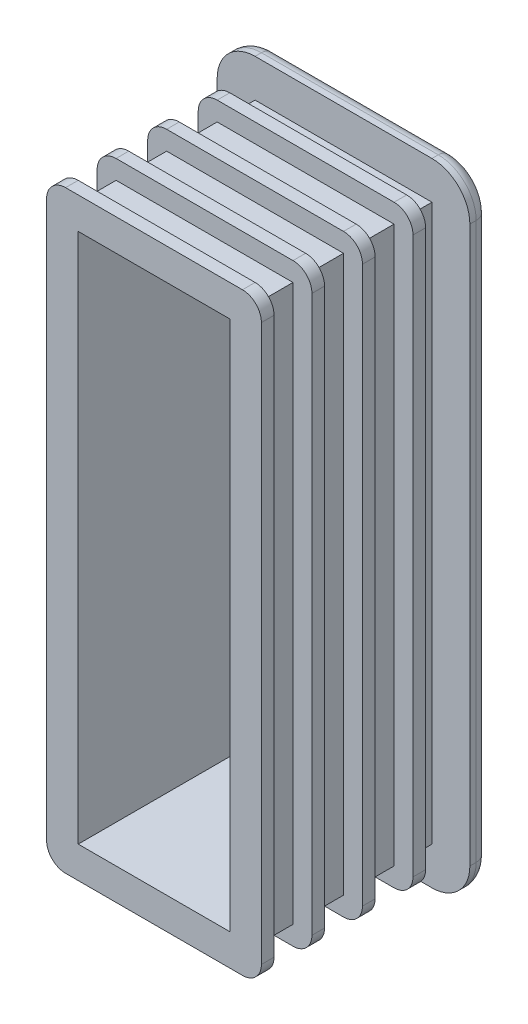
ISO-10303-21;
HEADER;
FILE_DESCRIPTION(('STEP AP214'),'2;1');
FILE_NAME('part.step','',(''),(''),'','','');
FILE_SCHEMA(('AUTOMOTIVE_DESIGN { 1 0 10303 214 1 1 1 1 }'));
ENDSEC;
DATA;
#1=APPLICATION_CONTEXT('core data for automotive mechanical design processes');
#2=APPLICATION_PROTOCOL_DEFINITION('international standard','automotive_design',2000,#1);
#3=PRODUCT_CONTEXT('',#1,'mechanical');
#4=PRODUCT('Part','Part','',(#3));
#5=PRODUCT_RELATED_PRODUCT_CATEGORY('part','',(#4));
#6=PRODUCT_DEFINITION_FORMATION('','',#4);
#7=PRODUCT_DEFINITION_CONTEXT('part definition',#1,'design');
#8=PRODUCT_DEFINITION('design','',#6,#7);
#9=PRODUCT_DEFINITION_SHAPE('','',#8);
#10=(LENGTH_UNIT() NAMED_UNIT(*) SI_UNIT(.MILLI.,.METRE.));
#11=(NAMED_UNIT(*) PLANE_ANGLE_UNIT() SI_UNIT($,.RADIAN.));
#12=(NAMED_UNIT(*) SI_UNIT($,.STERADIAN.) SOLID_ANGLE_UNIT());
#13=UNCERTAINTY_MEASURE_WITH_UNIT(LENGTH_MEASURE(1.E-05),#10,'distance_accuracy_value','');
#14=(GEOMETRIC_REPRESENTATION_CONTEXT(3) GLOBAL_UNCERTAINTY_ASSIGNED_CONTEXT((#13)) GLOBAL_UNIT_ASSIGNED_CONTEXT((#10,
#11,#12)) REPRESENTATION_CONTEXT('',''));
#15=CARTESIAN_POINT('',(0.,0.,0.));
#16=DIRECTION('',(0.,0.,1.));
#17=DIRECTION('',(1.,0.,0.));
#18=AXIS2_PLACEMENT_3D('',#15,#16,#17);
#19=CARTESIAN_POINT('',(34.,94.,33.));
#20=DIRECTION('',(0.,-1.,0.));
#21=DIRECTION('',(0.,0.,-1.));
#22=AXIS2_PLACEMENT_3D('',#19,#20,#21);
#23=PLANE('',#22);
#24=DIRECTION('',(0.,0.,-1.));
#25=VECTOR('',#24,1.);
#26=CARTESIAN_POINT('',(34.,94.,33.));
#27=LINE('',#26,#25);
#28=CARTESIAN_POINT('',(34.,94.,31.));
#29=VERTEX_POINT('',#28);
#30=CARTESIAN_POINT('',(34.,94.,25.));
#31=VERTEX_POINT('',#30);
#32=EDGE_CURVE('E455',#29,#31,#27,.T.);
#33=ORIENTED_EDGE('',*,*,#32,.T.);
#34=DIRECTION('',(-1.,0.,0.));
#35=VECTOR('',#34,1.);
#36=CARTESIAN_POINT('',(6.,94.,25.));
#37=LINE('',#36,#35);
#38=CARTESIAN_POINT('',(6.,94.,25.));
#39=VERTEX_POINT('',#38);
#40=EDGE_CURVE('E707',#31,#39,#37,.T.);
#41=ORIENTED_EDGE('',*,*,#40,.T.);
#42=DIRECTION('',(0.,0.,-1.));
#43=VECTOR('',#42,1.);
#44=CARTESIAN_POINT('',(6.,94.,33.));
#45=LINE('',#44,#43);
#46=CARTESIAN_POINT('',(6.,94.,31.));
#47=VERTEX_POINT('',#46);
#48=EDGE_CURVE('E466',#47,#39,#45,.T.);
#49=ORIENTED_EDGE('',*,*,#48,.F.);
#50=DIRECTION('',(-1.,0.,0.));
#51=VECTOR('',#50,1.);
#52=CARTESIAN_POINT('',(6.,94.,31.));
#53=LINE('',#52,#51);
#54=EDGE_CURVE('E709',#29,#47,#53,.T.);
#55=ORIENTED_EDGE('',*,*,#54,.F.);
#56=EDGE_LOOP('',(#33,#41,#49,#55));
#57=FACE_BOUND('',#56,.T.);
#58=ADVANCED_FACE('F24',(#57),#23,.F.);
#59=CARTESIAN_POINT('',(6.,94.,33.));
#60=DIRECTION('',(1.,0.,0.));
#61=DIRECTION('',(0.,0.,-1.));
#62=AXIS2_PLACEMENT_3D('',#59,#60,#61);
#63=PLANE('',#62);
#64=ORIENTED_EDGE('',*,*,#48,.T.);
#65=DIRECTION('',(0.,-1.,0.));
#66=VECTOR('',#65,1.);
#67=CARTESIAN_POINT('',(6.,94.,25.));
#68=LINE('',#67,#66);
#69=CARTESIAN_POINT('',(6.,6.00000000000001,25.));
#70=VERTEX_POINT('',#69);
#71=EDGE_CURVE('E723',#39,#70,#68,.T.);
#72=ORIENTED_EDGE('',*,*,#71,.T.);
#73=DIRECTION('',(0.,0.,-1.));
#74=VECTOR('',#73,1.);
#75=CARTESIAN_POINT('',(6.,6.,33.));
#76=LINE('',#75,#74);
#77=CARTESIAN_POINT('',(6.,6.,31.));
#78=VERTEX_POINT('',#77);
#79=EDGE_CURVE('E461',#78,#70,#76,.T.);
#80=ORIENTED_EDGE('',*,*,#79,.F.);
#81=DIRECTION('',(0.,-1.,0.));
#82=VECTOR('',#81,1.);
#83=CARTESIAN_POINT('',(6.,94.,31.));
#84=LINE('',#83,#82);
#85=EDGE_CURVE('E789',#47,#78,#84,.T.);
#86=ORIENTED_EDGE('',*,*,#85,.F.);
#87=EDGE_LOOP('',(#64,#72,#80,#86));
#88=FACE_BOUND('',#87,.T.);
#89=ADVANCED_FACE('F648',(#88),#63,.F.);
#90=CARTESIAN_POINT('',(6.,6.,33.));
#91=DIRECTION('',(0.,1.,0.));
#92=DIRECTION('',(0.,0.,1.));
#93=AXIS2_PLACEMENT_3D('',#90,#91,#92);
#94=PLANE('',#93);
#95=ORIENTED_EDGE('',*,*,#79,.T.);
#96=DIRECTION('',(1.,0.,0.));
#97=VECTOR('',#96,1.);
#98=CARTESIAN_POINT('',(6.,6.,25.));
#99=LINE('',#98,#97);
#100=CARTESIAN_POINT('',(34.,6.,25.));
#101=VERTEX_POINT('',#100);
#102=EDGE_CURVE('E719',#70,#101,#99,.T.);
#103=ORIENTED_EDGE('',*,*,#102,.T.);
#104=DIRECTION('',(0.,0.,-1.));
#105=VECTOR('',#104,1.);
#106=CARTESIAN_POINT('',(34.,6.,33.));
#107=LINE('',#106,#105);
#108=CARTESIAN_POINT('',(34.,6.,31.));
#109=VERTEX_POINT('',#108);
#110=EDGE_CURVE('E454',#109,#101,#107,.T.);
#111=ORIENTED_EDGE('',*,*,#110,.F.);
#112=DIRECTION('',(1.,0.,0.));
#113=VECTOR('',#112,1.);
#114=CARTESIAN_POINT('',(6.,6.,31.));
#115=LINE('',#114,#113);
#116=EDGE_CURVE('E805',#78,#109,#115,.T.);
#117=ORIENTED_EDGE('',*,*,#116,.F.);
#118=EDGE_LOOP('',(#95,#103,#111,#117));
#119=FACE_BOUND('',#118,.T.);
#120=ADVANCED_FACE('F657',(#119),#94,.F.);
#121=CARTESIAN_POINT('',(34.,6.,33.));
#122=DIRECTION('',(-1.,0.,0.));
#123=DIRECTION('',(0.,0.,1.));
#124=AXIS2_PLACEMENT_3D('',#121,#122,#123);
#125=PLANE('',#124);
#126=ORIENTED_EDGE('',*,*,#110,.T.);
#127=DIRECTION('',(0.,1.,0.));
#128=VECTOR('',#127,1.);
#129=CARTESIAN_POINT('',(34.,94.,25.));
#130=LINE('',#129,#128);
#131=EDGE_CURVE('E716',#101,#31,#130,.T.);
#132=ORIENTED_EDGE('',*,*,#131,.T.);
#133=ORIENTED_EDGE('',*,*,#32,.F.);
#134=DIRECTION('',(0.,1.,0.));
#135=VECTOR('',#134,1.);
#136=CARTESIAN_POINT('',(34.,94.,31.));
#137=LINE('',#136,#135);
#138=EDGE_CURVE('E714',#109,#29,#137,.T.);
#139=ORIENTED_EDGE('',*,*,#138,.F.);
#140=EDGE_LOOP('',(#126,#132,#133,#139));
#141=FACE_BOUND('',#140,.T.);
#142=ADVANCED_FACE('F713',(#141),#125,.F.);
#143=CARTESIAN_POINT('',(6.,94.,31.));
#144=DIRECTION('',(0.,0.,1.));
#145=DIRECTION('',(1.,0.,0.));
#146=AXIS2_PLACEMENT_3D('',#143,#144,#145);
#147=CYLINDRICAL_SURFACE('',#146,3.);
#148=CARTESIAN_POINT('',(6.,94.,33.));
#149=DIRECTION('',(0.,0.,1.));
#150=DIRECTION('',(1.,0.,0.));
#151=AXIS2_PLACEMENT_3D('',#148,#149,#150);
#152=CIRCLE('',#151,3.);
#153=CARTESIAN_POINT('',(6.00000000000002,97.,33.));
#154=VERTEX_POINT('',#153);
#155=CARTESIAN_POINT('',(3.,94.,33.));
#156=VERTEX_POINT('',#155);
#157=EDGE_CURVE('E810',#154,#156,#152,.T.);
#158=ORIENTED_EDGE('',*,*,#157,.F.);
#159=DIRECTION('',(0.,0.,1.));
#160=VECTOR('',#159,1.);
#161=CARTESIAN_POINT('',(6.00000000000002,97.,31.));
#162=LINE('',#161,#160);
#163=CARTESIAN_POINT('',(6.00000000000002,97.,31.));
#164=VERTEX_POINT('',#163);
#165=EDGE_CURVE('E859',#164,#154,#162,.T.);
#166=ORIENTED_EDGE('',*,*,#165,.F.);
#167=CARTESIAN_POINT('',(6.,94.,31.));
#168=DIRECTION('',(0.,0.,1.));
#169=DIRECTION('',(1.,0.,0.));
#170=AXIS2_PLACEMENT_3D('',#167,#168,#169);
#171=CIRCLE('',#170,3.);
#172=CARTESIAN_POINT('',(3.,94.,31.));
#173=VERTEX_POINT('',#172);
#174=EDGE_CURVE('E834',#164,#173,#171,.T.);
#175=ORIENTED_EDGE('',*,*,#174,.T.);
#176=DIRECTION('',(0.,0.,1.));
#177=VECTOR('',#176,1.);
#178=CARTESIAN_POINT('',(3.,94.,31.));
#179=LINE('',#178,#177);
#180=EDGE_CURVE('E858',#173,#156,#179,.T.);
#181=ORIENTED_EDGE('',*,*,#180,.T.);
#182=EDGE_LOOP('',(#158,#166,#175,#181));
#183=FACE_BOUND('',#182,.T.);
#184=ADVANCED_FACE('F1054',(#183),#147,.T.);
#185=CARTESIAN_POINT('',(6.00000000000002,97.,31.));
#186=DIRECTION('',(0.,1.,0.));
#187=DIRECTION('',(0.,0.,1.));
#188=AXIS2_PLACEMENT_3D('',#185,#186,#187);
#189=PLANE('',#188);
#190=DIRECTION('',(-1.,0.,0.));
#191=VECTOR('',#190,1.);
#192=CARTESIAN_POINT('',(6.00000000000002,97.,33.));
#193=LINE('',#192,#191);
#194=CARTESIAN_POINT('',(34.,97.,33.));
#195=VERTEX_POINT('',#194);
#196=EDGE_CURVE('E831',#195,#154,#193,.T.);
#197=ORIENTED_EDGE('',*,*,#196,.F.);
#198=DIRECTION('',(0.,0.,1.));
#199=VECTOR('',#198,1.);
#200=CARTESIAN_POINT('',(34.,97.,31.));
#201=LINE('',#200,#199);
#202=CARTESIAN_POINT('',(34.,97.,31.));
#203=VERTEX_POINT('',#202);
#204=EDGE_CURVE('E862',#203,#195,#201,.T.);
#205=ORIENTED_EDGE('',*,*,#204,.F.);
#206=DIRECTION('',(-1.,0.,0.));
#207=VECTOR('',#206,1.);
#208=CARTESIAN_POINT('',(6.00000000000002,97.,31.));
#209=LINE('',#208,#207);
#210=EDGE_CURVE('E855',#203,#164,#209,.T.);
#211=ORIENTED_EDGE('',*,*,#210,.T.);
#212=ORIENTED_EDGE('',*,*,#165,.T.);
#213=EDGE_LOOP('',(#197,#205,#211,#212));
#214=FACE_BOUND('',#213,.T.);
#215=ADVANCED_FACE('F1032',(#214),#189,.T.);
#216=CARTESIAN_POINT('',(34.,94.,31.));
#217=DIRECTION('',(0.,0.,1.));
#218=DIRECTION('',(1.,0.,0.));
#219=AXIS2_PLACEMENT_3D('',#216,#217,#218);
#220=CYLINDRICAL_SURFACE('',#219,3.);
#221=CARTESIAN_POINT('',(34.,94.,33.));
#222=DIRECTION('',(0.,0.,1.));
#223=DIRECTION('',(1.,0.,0.));
#224=AXIS2_PLACEMENT_3D('',#221,#222,#223);
#225=CIRCLE('',#224,3.);
#226=CARTESIAN_POINT('',(37.,94.,33.));
#227=VERTEX_POINT('',#226);
#228=EDGE_CURVE('E828',#227,#195,#225,.T.);
#229=ORIENTED_EDGE('',*,*,#228,.F.);
#230=DIRECTION('',(0.,0.,1.));
#231=VECTOR('',#230,1.);
#232=CARTESIAN_POINT('',(37.,94.,31.));
#233=LINE('',#232,#231);
#234=CARTESIAN_POINT('',(37.,94.,31.));
#235=VERTEX_POINT('',#234);
#236=EDGE_CURVE('E864',#235,#227,#233,.T.);
#237=ORIENTED_EDGE('',*,*,#236,.F.);
#238=CARTESIAN_POINT('',(34.,94.,31.));
#239=DIRECTION('',(0.,0.,1.));
#240=DIRECTION('',(1.,0.,0.));
#241=AXIS2_PLACEMENT_3D('',#238,#239,#240);
#242=CIRCLE('',#241,3.);
#243=EDGE_CURVE('E852',#235,#203,#242,.T.);
#244=ORIENTED_EDGE('',*,*,#243,.T.);
#245=ORIENTED_EDGE('',*,*,#204,.T.);
#246=EDGE_LOOP('',(#229,#237,#244,#245));
#247=FACE_BOUND('',#246,.T.);
#248=ADVANCED_FACE('F1036',(#247),#220,.T.);
#249=CARTESIAN_POINT('',(37.,94.,31.));
#250=DIRECTION('',(1.,0.,0.));
#251=DIRECTION('',(0.,1.,0.));
#252=AXIS2_PLACEMENT_3D('',#249,#250,#251);
#253=PLANE('',#252);
#254=DIRECTION('',(0.,1.,0.));
#255=VECTOR('',#254,1.);
#256=CARTESIAN_POINT('',(37.,94.,33.));
#257=LINE('',#256,#255);
#258=CARTESIAN_POINT('',(37.,6.00000000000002,33.));
#259=VERTEX_POINT('',#258);
#260=EDGE_CURVE('E825',#259,#227,#257,.T.);
#261=ORIENTED_EDGE('',*,*,#260,.F.);
#262=DIRECTION('',(0.,0.,1.));
#263=VECTOR('',#262,1.);
#264=CARTESIAN_POINT('',(37.,6.00000000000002,31.));
#265=LINE('',#264,#263);
#266=CARTESIAN_POINT('',(37.,6.00000000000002,31.));
#267=VERTEX_POINT('',#266);
#268=EDGE_CURVE('E866',#267,#259,#265,.T.);
#269=ORIENTED_EDGE('',*,*,#268,.F.);
#270=DIRECTION('',(0.,1.,0.));
#271=VECTOR('',#270,1.);
#272=CARTESIAN_POINT('',(37.,94.,31.));
#273=LINE('',#272,#271);
#274=EDGE_CURVE('E849',#267,#235,#273,.T.);
#275=ORIENTED_EDGE('',*,*,#274,.T.);
#276=ORIENTED_EDGE('',*,*,#236,.T.);
#277=EDGE_LOOP('',(#261,#269,#275,#276));
#278=FACE_BOUND('',#277,.T.);
#279=ADVANCED_FACE('F1041',(#278),#253,.T.);
#280=CARTESIAN_POINT('',(34.,6.,31.));
#281=DIRECTION('',(0.,0.,1.));
#282=DIRECTION('',(1.,0.,0.));
#283=AXIS2_PLACEMENT_3D('',#280,#281,#282);
#284=CYLINDRICAL_SURFACE('',#283,3.);
#285=CARTESIAN_POINT('',(34.,6.,33.));
#286=DIRECTION('',(0.,0.,1.));
#287=DIRECTION('',(1.,0.,0.));
#288=AXIS2_PLACEMENT_3D('',#285,#286,#287);
#289=CIRCLE('',#288,3.);
#290=CARTESIAN_POINT('',(34.,3.,33.));
#291=VERTEX_POINT('',#290);
#292=EDGE_CURVE('E822',#291,#259,#289,.T.);
#293=ORIENTED_EDGE('',*,*,#292,.F.);
#294=DIRECTION('',(0.,0.,1.));
#295=VECTOR('',#294,1.);
#296=CARTESIAN_POINT('',(34.,3.,31.));
#297=LINE('',#296,#295);
#298=CARTESIAN_POINT('',(34.,3.,31.));
#299=VERTEX_POINT('',#298);
#300=EDGE_CURVE('E868',#299,#291,#297,.T.);
#301=ORIENTED_EDGE('',*,*,#300,.F.);
#302=CARTESIAN_POINT('',(34.,6.,31.));
#303=DIRECTION('',(0.,0.,1.));
#304=DIRECTION('',(1.,0.,0.));
#305=AXIS2_PLACEMENT_3D('',#302,#303,#304);
#306=CIRCLE('',#305,3.);
#307=EDGE_CURVE('E846',#299,#267,#306,.T.);
#308=ORIENTED_EDGE('',*,*,#307,.T.);
#309=ORIENTED_EDGE('',*,*,#268,.T.);
#310=EDGE_LOOP('',(#293,#301,#308,#309));
#311=FACE_BOUND('',#310,.T.);
#312=ADVANCED_FACE('F1044',(#311),#284,.T.);
#313=CARTESIAN_POINT('',(6.00000000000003,3.,31.));
#314=DIRECTION('',(0.,-1.,0.));
#315=DIRECTION('',(0.,0.,-1.));
#316=AXIS2_PLACEMENT_3D('',#313,#314,#315);
#317=PLANE('',#316);
#318=DIRECTION('',(1.,0.,0.));
#319=VECTOR('',#318,1.);
#320=CARTESIAN_POINT('',(6.00000000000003,3.,33.));
#321=LINE('',#320,#319);
#322=CARTESIAN_POINT('',(6.00000000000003,3.,33.));
#323=VERTEX_POINT('',#322);
#324=EDGE_CURVE('E819',#323,#291,#321,.T.);
#325=ORIENTED_EDGE('',*,*,#324,.F.);
#326=DIRECTION('',(0.,0.,1.));
#327=VECTOR('',#326,1.);
#328=CARTESIAN_POINT('',(6.00000000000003,3.,31.));
#329=LINE('',#328,#327);
#330=CARTESIAN_POINT('',(6.00000000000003,3.,31.));
#331=VERTEX_POINT('',#330);
#332=EDGE_CURVE('E870',#331,#323,#329,.T.);
#333=ORIENTED_EDGE('',*,*,#332,.F.);
#334=DIRECTION('',(1.,0.,0.));
#335=VECTOR('',#334,1.);
#336=CARTESIAN_POINT('',(6.00000000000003,3.,31.));
#337=LINE('',#336,#335);
#338=EDGE_CURVE('E843',#331,#299,#337,.T.);
#339=ORIENTED_EDGE('',*,*,#338,.T.);
#340=ORIENTED_EDGE('',*,*,#300,.T.);
#341=EDGE_LOOP('',(#325,#333,#339,#340));
#342=FACE_BOUND('',#341,.T.);
#343=ADVANCED_FACE('F1048',(#342),#317,.T.);
#344=CARTESIAN_POINT('',(6.00000000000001,6.,31.));
#345=DIRECTION('',(0.,0.,1.));
#346=DIRECTION('',(1.,0.,0.));
#347=AXIS2_PLACEMENT_3D('',#344,#345,#346);
#348=CYLINDRICAL_SURFACE('',#347,3.);
#349=CARTESIAN_POINT('',(6.00000000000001,6.,33.));
#350=DIRECTION('',(0.,0.,1.));
#351=DIRECTION('',(1.,0.,0.));
#352=AXIS2_PLACEMENT_3D('',#349,#350,#351);
#353=CIRCLE('',#352,3.);
#354=CARTESIAN_POINT('',(3.00000000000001,6.00000000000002,33.));
#355=VERTEX_POINT('',#354);
#356=EDGE_CURVE('E816',#355,#323,#353,.T.);
#357=ORIENTED_EDGE('',*,*,#356,.F.);
#358=DIRECTION('',(0.,0.,1.));
#359=VECTOR('',#358,1.);
#360=CARTESIAN_POINT('',(3.00000000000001,6.00000000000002,31.));
#361=LINE('',#360,#359);
#362=CARTESIAN_POINT('',(3.00000000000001,6.00000000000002,31.));
#363=VERTEX_POINT('',#362);
#364=EDGE_CURVE('E872',#363,#355,#361,.T.);
#365=ORIENTED_EDGE('',*,*,#364,.F.);
#366=CARTESIAN_POINT('',(6.00000000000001,6.,31.));
#367=DIRECTION('',(0.,0.,1.));
#368=DIRECTION('',(1.,0.,0.));
#369=AXIS2_PLACEMENT_3D('',#366,#367,#368);
#370=CIRCLE('',#369,3.);
#371=EDGE_CURVE('E840',#363,#331,#370,.T.);
#372=ORIENTED_EDGE('',*,*,#371,.T.);
#373=ORIENTED_EDGE('',*,*,#332,.T.);
#374=EDGE_LOOP('',(#357,#365,#372,#373));
#375=FACE_BOUND('',#374,.T.);
#376=ADVANCED_FACE('F1051',(#375),#348,.T.);
#377=CARTESIAN_POINT('',(3.,94.,31.));
#378=DIRECTION('',(-1.,0.,0.));
#379=DIRECTION('',(0.,-1.,0.));
#380=AXIS2_PLACEMENT_3D('',#377,#378,#379);
#381=PLANE('',#380);
#382=DIRECTION('',(0.,-1.,0.));
#383=VECTOR('',#382,1.);
#384=CARTESIAN_POINT('',(3.,94.,33.));
#385=LINE('',#384,#383);
#386=EDGE_CURVE('E813',#156,#355,#385,.T.);
#387=ORIENTED_EDGE('',*,*,#386,.F.);
#388=ORIENTED_EDGE('',*,*,#180,.F.);
#389=DIRECTION('',(0.,-1.,0.));
#390=VECTOR('',#389,1.);
#391=CARTESIAN_POINT('',(3.,94.,31.));
#392=LINE('',#391,#390);
#393=EDGE_CURVE('E837',#173,#363,#392,.T.);
#394=ORIENTED_EDGE('',*,*,#393,.T.);
#395=ORIENTED_EDGE('',*,*,#364,.T.);
#396=EDGE_LOOP('',(#387,#388,#394,#395));
#397=FACE_BOUND('',#396,.T.);
#398=ADVANCED_FACE('F1022',(#397),#381,.T.);
#399=CARTESIAN_POINT('',(6.,94.,31.));
#400=DIRECTION('',(0.,0.,1.));
#401=DIRECTION('',(1.,0.,0.));
#402=AXIS2_PLACEMENT_3D('',#399,#400,#401);
#403=PLANE('',#402);
#404=ORIENTED_EDGE('',*,*,#54,.T.);
#405=ORIENTED_EDGE('',*,*,#85,.T.);
#406=ORIENTED_EDGE('',*,*,#116,.T.);
#407=ORIENTED_EDGE('',*,*,#138,.T.);
#408=EDGE_LOOP('',(#404,#405,#406,#407));
#409=FACE_BOUND('',#408,.T.);
#410=ORIENTED_EDGE('',*,*,#174,.F.);
#411=ORIENTED_EDGE('',*,*,#210,.F.);
#412=ORIENTED_EDGE('',*,*,#243,.F.);
#413=ORIENTED_EDGE('',*,*,#274,.F.);
#414=ORIENTED_EDGE('',*,*,#307,.F.);
#415=ORIENTED_EDGE('',*,*,#338,.F.);
#416=ORIENTED_EDGE('',*,*,#371,.F.);
#417=ORIENTED_EDGE('',*,*,#393,.F.);
#418=EDGE_LOOP('',(#410,#411,#412,#413,#414,#415,#416,#417));
#419=FACE_BOUND('',#418,.T.);
#420=ADVANCED_FACE('F1018',(#409,#419),#403,.F.);
#421=CARTESIAN_POINT('',(6.,94.,3.));
#422=DIRECTION('',(0.,0.,-1.));
#423=DIRECTION('',(-1.,0.,0.));
#424=AXIS2_PLACEMENT_3D('',#421,#422,#423);
#425=PLANE('',#424);
#426=DIRECTION('',(-1.,0.,0.));
#427=VECTOR('',#426,1.);
#428=CARTESIAN_POINT('',(8.,92.,3.));
#429=LINE('',#428,#427);
#430=CARTESIAN_POINT('',(32.,92.,3.));
#431=VERTEX_POINT('',#430);
#432=CARTESIAN_POINT('',(8.,92.,3.));
#433=VERTEX_POINT('',#432);
#434=EDGE_CURVE('E883',#431,#433,#429,.T.);
#435=ORIENTED_EDGE('',*,*,#434,.T.);
#436=DIRECTION('',(0.,-1.,0.));
#437=VECTOR('',#436,1.);
#438=CARTESIAN_POINT('',(8.,92.,3.));
#439=LINE('',#438,#437);
#440=CARTESIAN_POINT('',(8.00000000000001,8.,3.));
#441=VERTEX_POINT('',#440);
#442=EDGE_CURVE('E861',#433,#441,#439,.T.);
#443=ORIENTED_EDGE('',*,*,#442,.T.);
#444=DIRECTION('',(1.,0.,0.));
#445=VECTOR('',#444,1.);
#446=CARTESIAN_POINT('',(8.00000000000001,8.,3.));
#447=LINE('',#446,#445);
#448=CARTESIAN_POINT('',(32.,8.,3.));
#449=VERTEX_POINT('',#448);
#450=EDGE_CURVE('E877',#441,#449,#447,.T.);
#451=ORIENTED_EDGE('',*,*,#450,.T.);
#452=DIRECTION('',(0.,1.,0.));
#453=VECTOR('',#452,1.);
#454=CARTESIAN_POINT('',(32.,92.,3.));
#455=LINE('',#454,#453);
#456=EDGE_CURVE('E880',#449,#431,#455,.T.);
#457=ORIENTED_EDGE('',*,*,#456,.T.);
#458=EDGE_LOOP('',(#435,#443,#451,#457));
#459=FACE_BOUND('',#458,.T.);
#460=ADVANCED_FACE('F1021',(#459),#425,.F.);
#461=CARTESIAN_POINT('',(32.,92.,33.));
#462=DIRECTION('',(-1.,0.,0.));
#463=DIRECTION('',(0.,-1.,0.));
#464=AXIS2_PLACEMENT_3D('',#461,#462,#463);
#465=PLANE('',#464);
#466=ORIENTED_EDGE('',*,*,#456,.F.);
#467=DIRECTION('',(0.,0.,-1.));
#468=VECTOR('',#467,1.);
#469=CARTESIAN_POINT('',(32.,8.,33.));
#470=LINE('',#469,#468);
#471=CARTESIAN_POINT('',(32.,8.,33.));
#472=VERTEX_POINT('',#471);
#473=EDGE_CURVE('E899',#472,#449,#470,.T.);
#474=ORIENTED_EDGE('',*,*,#473,.F.);
#475=DIRECTION('',(0.,1.,0.));
#476=VECTOR('',#475,1.);
#477=CARTESIAN_POINT('',(32.,92.,33.));
#478=LINE('',#477,#476);
#479=CARTESIAN_POINT('',(32.,92.,33.));
#480=VERTEX_POINT('',#479);
#481=EDGE_CURVE('E890',#472,#480,#478,.T.);
#482=ORIENTED_EDGE('',*,*,#481,.T.);
#483=DIRECTION('',(0.,0.,-1.));
#484=VECTOR('',#483,1.);
#485=CARTESIAN_POINT('',(32.,92.,33.));
#486=LINE('',#485,#484);
#487=EDGE_CURVE('E897',#480,#431,#486,.T.);
#488=ORIENTED_EDGE('',*,*,#487,.T.);
#489=EDGE_LOOP('',(#466,#474,#482,#488));
#490=FACE_BOUND('',#489,.T.);
#491=ADVANCED_FACE('F1303',(#490),#465,.T.);
#492=CARTESIAN_POINT('',(8.,92.,33.));
#493=DIRECTION('',(0.,-1.,0.));
#494=DIRECTION('',(0.,0.,-1.));
#495=AXIS2_PLACEMENT_3D('',#492,#493,#494);
#496=PLANE('',#495);
#497=ORIENTED_EDGE('',*,*,#434,.F.);
#498=ORIENTED_EDGE('',*,*,#487,.F.);
#499=DIRECTION('',(-1.,0.,0.));
#500=VECTOR('',#499,1.);
#501=CARTESIAN_POINT('',(8.,92.,33.));
#502=LINE('',#501,#500);
#503=CARTESIAN_POINT('',(8.,92.,33.));
#504=VERTEX_POINT('',#503);
#505=EDGE_CURVE('E893',#480,#504,#502,.T.);
#506=ORIENTED_EDGE('',*,*,#505,.T.);
#507=DIRECTION('',(0.,0.,-1.));
#508=VECTOR('',#507,1.);
#509=CARTESIAN_POINT('',(8.,92.,33.));
#510=LINE('',#509,#508);
#511=EDGE_CURVE('E895',#504,#433,#510,.T.);
#512=ORIENTED_EDGE('',*,*,#511,.T.);
#513=EDGE_LOOP('',(#497,#498,#506,#512));
#514=FACE_BOUND('',#513,.T.);
#515=ADVANCED_FACE('F1300',(#514),#496,.T.);
#516=CARTESIAN_POINT('',(8.,92.,33.));
#517=DIRECTION('',(1.,0.,0.));
#518=DIRECTION('',(0.,1.,0.));
#519=AXIS2_PLACEMENT_3D('',#516,#517,#518);
#520=PLANE('',#519);
#521=ORIENTED_EDGE('',*,*,#442,.F.);
#522=ORIENTED_EDGE('',*,*,#511,.F.);
#523=DIRECTION('',(0.,-1.,0.));
#524=VECTOR('',#523,1.);
#525=CARTESIAN_POINT('',(8.,92.,33.));
#526=LINE('',#525,#524);
#527=CARTESIAN_POINT('',(8.00000000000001,8.,33.));
#528=VERTEX_POINT('',#527);
#529=EDGE_CURVE('E886',#504,#528,#526,.T.);
#530=ORIENTED_EDGE('',*,*,#529,.T.);
#531=DIRECTION('',(0.,0.,-1.));
#532=VECTOR('',#531,1.);
#533=CARTESIAN_POINT('',(8.00000000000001,8.,33.));
#534=LINE('',#533,#532);
#535=EDGE_CURVE('E901',#528,#441,#534,.T.);
#536=ORIENTED_EDGE('',*,*,#535,.T.);
#537=EDGE_LOOP('',(#521,#522,#530,#536));
#538=FACE_BOUND('',#537,.T.);
#539=ADVANCED_FACE('F1068',(#538),#520,.T.);
#540=CARTESIAN_POINT('',(8.00000000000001,8.,33.));
#541=DIRECTION('',(0.,1.,0.));
#542=DIRECTION('',(0.,0.,1.));
#543=AXIS2_PLACEMENT_3D('',#540,#541,#542);
#544=PLANE('',#543);
#545=ORIENTED_EDGE('',*,*,#450,.F.);
#546=ORIENTED_EDGE('',*,*,#535,.F.);
#547=DIRECTION('',(1.,0.,0.));
#548=VECTOR('',#547,1.);
#549=CARTESIAN_POINT('',(8.00000000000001,8.,33.));
#550=LINE('',#549,#548);
#551=EDGE_CURVE('E888',#528,#472,#550,.T.);
#552=ORIENTED_EDGE('',*,*,#551,.T.);
#553=ORIENTED_EDGE('',*,*,#473,.T.);
#554=EDGE_LOOP('',(#545,#546,#552,#553));
#555=FACE_BOUND('',#554,.T.);
#556=ADVANCED_FACE('F1058',(#555),#544,.T.);
#557=CARTESIAN_POINT('',(6.,94.,33.));
#558=DIRECTION('',(0.,0.,1.));
#559=DIRECTION('',(1.,0.,0.));
#560=AXIS2_PLACEMENT_3D('',#557,#558,#559);
#561=PLANE('',#560);
#562=ORIENTED_EDGE('',*,*,#551,.F.);
#563=ORIENTED_EDGE('',*,*,#529,.F.);
#564=ORIENTED_EDGE('',*,*,#505,.F.);
#565=ORIENTED_EDGE('',*,*,#481,.F.);
#566=EDGE_LOOP('',(#562,#563,#564,#565));
#567=FACE_BOUND('',#566,.T.);
#568=ORIENTED_EDGE('',*,*,#157,.T.);
#569=ORIENTED_EDGE('',*,*,#386,.T.);
#570=ORIENTED_EDGE('',*,*,#356,.T.);
#571=ORIENTED_EDGE('',*,*,#324,.T.);
#572=ORIENTED_EDGE('',*,*,#292,.T.);
#573=ORIENTED_EDGE('',*,*,#260,.T.);
#574=ORIENTED_EDGE('',*,*,#228,.T.);
#575=ORIENTED_EDGE('',*,*,#196,.T.);
#576=EDGE_LOOP('',(#568,#569,#570,#571,#572,#573,#574,#575));
#577=FACE_BOUND('',#576,.T.);
#578=ADVANCED_FACE('F1056',(#567,#577),#561,.T.);
#579=CARTESIAN_POINT('',(6.,94.,23.));
#580=DIRECTION('',(0.,0.,1.));
#581=DIRECTION('',(1.,0.,0.));
#582=AXIS2_PLACEMENT_3D('',#579,#580,#581);
#583=CYLINDRICAL_SURFACE('',#582,3.);
#584=CARTESIAN_POINT('',(6.,94.,25.));
#585=DIRECTION('',(0.,0.,1.));
#586=DIRECTION('',(1.,0.,0.));
#587=AXIS2_PLACEMENT_3D('',#584,#585,#586);
#588=CIRCLE('',#587,3.);
#589=CARTESIAN_POINT('',(6.00000000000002,97.,25.));
#590=VERTEX_POINT('',#589);
#591=CARTESIAN_POINT('',(3.,94.,25.));
#592=VERTEX_POINT('',#591);
#593=EDGE_CURVE('E738',#590,#592,#588,.T.);
#594=ORIENTED_EDGE('',*,*,#593,.F.);
#595=DIRECTION('',(0.,0.,1.));
#596=VECTOR('',#595,1.);
#597=CARTESIAN_POINT('',(6.00000000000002,97.,23.));
#598=LINE('',#597,#596);
#599=CARTESIAN_POINT('',(6.00000000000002,97.,23.));
#600=VERTEX_POINT('',#599);
#601=EDGE_CURVE('E787',#600,#590,#598,.T.);
#602=ORIENTED_EDGE('',*,*,#601,.F.);
#603=CARTESIAN_POINT('',(6.,94.,23.));
#604=DIRECTION('',(0.,0.,1.));
#605=DIRECTION('',(1.,0.,0.));
#606=AXIS2_PLACEMENT_3D('',#603,#604,#605);
#607=CIRCLE('',#606,3.);
#608=CARTESIAN_POINT('',(3.,94.,23.));
#609=VERTEX_POINT('',#608);
#610=EDGE_CURVE('E762',#600,#609,#607,.T.);
#611=ORIENTED_EDGE('',*,*,#610,.T.);
#612=DIRECTION('',(0.,0.,1.));
#613=VECTOR('',#612,1.);
#614=CARTESIAN_POINT('',(3.,94.,23.));
#615=LINE('',#614,#613);
#616=EDGE_CURVE('E786',#609,#592,#615,.T.);
#617=ORIENTED_EDGE('',*,*,#616,.T.);
#618=EDGE_LOOP('',(#594,#602,#611,#617));
#619=FACE_BOUND('',#618,.T.);
#620=ADVANCED_FACE('F1057',(#619),#583,.T.);
#621=CARTESIAN_POINT('',(6.00000000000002,97.,23.));
#622=DIRECTION('',(0.,1.,0.));
#623=DIRECTION('',(0.,0.,1.));
#624=AXIS2_PLACEMENT_3D('',#621,#622,#623);
#625=PLANE('',#624);
#626=DIRECTION('',(-1.,0.,0.));
#627=VECTOR('',#626,1.);
#628=CARTESIAN_POINT('',(6.00000000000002,97.,25.));
#629=LINE('',#628,#627);
#630=CARTESIAN_POINT('',(34.,97.,25.));
#631=VERTEX_POINT('',#630);
#632=EDGE_CURVE('E759',#631,#590,#629,.T.);
#633=ORIENTED_EDGE('',*,*,#632,.F.);
#634=DIRECTION('',(0.,0.,1.));
#635=VECTOR('',#634,1.);
#636=CARTESIAN_POINT('',(34.,97.,23.));
#637=LINE('',#636,#635);
#638=CARTESIAN_POINT('',(34.,97.,23.));
#639=VERTEX_POINT('',#638);
#640=EDGE_CURVE('E790',#639,#631,#637,.T.);
#641=ORIENTED_EDGE('',*,*,#640,.F.);
#642=DIRECTION('',(-1.,0.,0.));
#643=VECTOR('',#642,1.);
#644=CARTESIAN_POINT('',(6.00000000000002,97.,23.));
#645=LINE('',#644,#643);
#646=EDGE_CURVE('E783',#639,#600,#645,.T.);
#647=ORIENTED_EDGE('',*,*,#646,.T.);
#648=ORIENTED_EDGE('',*,*,#601,.T.);
#649=EDGE_LOOP('',(#633,#641,#647,#648));
#650=FACE_BOUND('',#649,.T.);
#651=ADVANCED_FACE('F1064',(#650),#625,.T.);
#652=CARTESIAN_POINT('',(34.,94.,23.));
#653=DIRECTION('',(0.,0.,1.));
#654=DIRECTION('',(1.,0.,0.));
#655=AXIS2_PLACEMENT_3D('',#652,#653,#654);
#656=CYLINDRICAL_SURFACE('',#655,3.);
#657=CARTESIAN_POINT('',(34.,94.,25.));
#658=DIRECTION('',(0.,0.,1.));
#659=DIRECTION('',(1.,0.,0.));
#660=AXIS2_PLACEMENT_3D('',#657,#658,#659);
#661=CIRCLE('',#660,3.);
#662=CARTESIAN_POINT('',(37.,94.,25.));
#663=VERTEX_POINT('',#662);
#664=EDGE_CURVE('E756',#663,#631,#661,.T.);
#665=ORIENTED_EDGE('',*,*,#664,.F.);
#666=DIRECTION('',(0.,0.,1.));
#667=VECTOR('',#666,1.);
#668=CARTESIAN_POINT('',(37.,94.,23.));
#669=LINE('',#668,#667);
#670=CARTESIAN_POINT('',(37.,94.,23.));
#671=VERTEX_POINT('',#670);
#672=EDGE_CURVE('E792',#671,#663,#669,.T.);
#673=ORIENTED_EDGE('',*,*,#672,.F.);
#674=CARTESIAN_POINT('',(34.,94.,23.));
#675=DIRECTION('',(0.,0.,1.));
#676=DIRECTION('',(1.,0.,0.));
#677=AXIS2_PLACEMENT_3D('',#674,#675,#676);
#678=CIRCLE('',#677,3.);
#679=EDGE_CURVE('E780',#671,#639,#678,.T.);
#680=ORIENTED_EDGE('',*,*,#679,.T.);
#681=ORIENTED_EDGE('',*,*,#640,.T.);
#682=EDGE_LOOP('',(#665,#673,#680,#681));
#683=FACE_BOUND('',#682,.T.);
#684=ADVANCED_FACE('F1260',(#683),#656,.T.);
#685=CARTESIAN_POINT('',(37.,94.,23.));
#686=DIRECTION('',(1.,0.,0.));
#687=DIRECTION('',(0.,1.,0.));
#688=AXIS2_PLACEMENT_3D('',#685,#686,#687);
#689=PLANE('',#688);
#690=DIRECTION('',(0.,1.,0.));
#691=VECTOR('',#690,1.);
#692=CARTESIAN_POINT('',(37.,94.,25.));
#693=LINE('',#692,#691);
#694=CARTESIAN_POINT('',(37.,6.00000000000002,25.));
#695=VERTEX_POINT('',#694);
#696=EDGE_CURVE('E753',#695,#663,#693,.T.);
#697=ORIENTED_EDGE('',*,*,#696,.F.);
#698=DIRECTION('',(0.,0.,1.));
#699=VECTOR('',#698,1.);
#700=CARTESIAN_POINT('',(37.,6.00000000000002,23.));
#701=LINE('',#700,#699);
#702=CARTESIAN_POINT('',(37.,6.00000000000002,23.));
#703=VERTEX_POINT('',#702);
#704=EDGE_CURVE('E794',#703,#695,#701,.T.);
#705=ORIENTED_EDGE('',*,*,#704,.F.);
#706=DIRECTION('',(0.,1.,0.));
#707=VECTOR('',#706,1.);
#708=CARTESIAN_POINT('',(37.,94.,23.));
#709=LINE('',#708,#707);
#710=EDGE_CURVE('E777',#703,#671,#709,.T.);
#711=ORIENTED_EDGE('',*,*,#710,.T.);
#712=ORIENTED_EDGE('',*,*,#672,.T.);
#713=EDGE_LOOP('',(#697,#705,#711,#712));
#714=FACE_BOUND('',#713,.T.);
#715=ADVANCED_FACE('F1264',(#714),#689,.T.);
#716=CARTESIAN_POINT('',(34.,6.,23.));
#717=DIRECTION('',(0.,0.,1.));
#718=DIRECTION('',(1.,0.,0.));
#719=AXIS2_PLACEMENT_3D('',#716,#717,#718);
#720=CYLINDRICAL_SURFACE('',#719,3.);
#721=CARTESIAN_POINT('',(34.,6.,25.));
#722=DIRECTION('',(0.,0.,1.));
#723=DIRECTION('',(1.,0.,0.));
#724=AXIS2_PLACEMENT_3D('',#721,#722,#723);
#725=CIRCLE('',#724,3.);
#726=CARTESIAN_POINT('',(34.,3.,25.));
#727=VERTEX_POINT('',#726);
#728=EDGE_CURVE('E750',#727,#695,#725,.T.);
#729=ORIENTED_EDGE('',*,*,#728,.F.);
#730=DIRECTION('',(0.,0.,1.));
#731=VECTOR('',#730,1.);
#732=CARTESIAN_POINT('',(34.,3.,23.));
#733=LINE('',#732,#731);
#734=CARTESIAN_POINT('',(34.,3.,23.));
#735=VERTEX_POINT('',#734);
#736=EDGE_CURVE('E796',#735,#727,#733,.T.);
#737=ORIENTED_EDGE('',*,*,#736,.F.);
#738=CARTESIAN_POINT('',(34.,6.,23.));
#739=DIRECTION('',(0.,0.,1.));
#740=DIRECTION('',(1.,0.,0.));
#741=AXIS2_PLACEMENT_3D('',#738,#739,#740);
#742=CIRCLE('',#741,3.);
#743=EDGE_CURVE('E774',#735,#703,#742,.T.);
#744=ORIENTED_EDGE('',*,*,#743,.T.);
#745=ORIENTED_EDGE('',*,*,#704,.T.);
#746=EDGE_LOOP('',(#729,#737,#744,#745));
#747=FACE_BOUND('',#746,.T.);
#748=ADVANCED_FACE('F1268',(#747),#720,.T.);
#749=CARTESIAN_POINT('',(6.00000000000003,3.,23.));
#750=DIRECTION('',(0.,-1.,0.));
#751=DIRECTION('',(0.,0.,-1.));
#752=AXIS2_PLACEMENT_3D('',#749,#750,#751);
#753=PLANE('',#752);
#754=DIRECTION('',(1.,0.,0.));
#755=VECTOR('',#754,1.);
#756=CARTESIAN_POINT('',(6.00000000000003,3.,25.));
#757=LINE('',#756,#755);
#758=CARTESIAN_POINT('',(6.00000000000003,3.,25.));
#759=VERTEX_POINT('',#758);
#760=EDGE_CURVE('E747',#759,#727,#757,.T.);
#761=ORIENTED_EDGE('',*,*,#760,.F.);
#762=DIRECTION('',(0.,0.,1.));
#763=VECTOR('',#762,1.);
#764=CARTESIAN_POINT('',(6.00000000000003,3.,23.));
#765=LINE('',#764,#763);
#766=CARTESIAN_POINT('',(6.00000000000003,3.,23.));
#767=VERTEX_POINT('',#766);
#768=EDGE_CURVE('E798',#767,#759,#765,.T.);
#769=ORIENTED_EDGE('',*,*,#768,.F.);
#770=DIRECTION('',(1.,0.,0.));
#771=VECTOR('',#770,1.);
#772=CARTESIAN_POINT('',(6.00000000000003,3.,23.));
#773=LINE('',#772,#771);
#774=EDGE_CURVE('E771',#767,#735,#773,.T.);
#775=ORIENTED_EDGE('',*,*,#774,.T.);
#776=ORIENTED_EDGE('',*,*,#736,.T.);
#777=EDGE_LOOP('',(#761,#769,#775,#776));
#778=FACE_BOUND('',#777,.T.);
#779=ADVANCED_FACE('F1272',(#778),#753,.T.);
#780=CARTESIAN_POINT('',(6.00000000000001,6.,23.));
#781=DIRECTION('',(0.,0.,1.));
#782=DIRECTION('',(1.,0.,0.));
#783=AXIS2_PLACEMENT_3D('',#780,#781,#782);
#784=CYLINDRICAL_SURFACE('',#783,3.);
#785=CARTESIAN_POINT('',(6.00000000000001,6.,25.));
#786=DIRECTION('',(0.,0.,1.));
#787=DIRECTION('',(1.,0.,0.));
#788=AXIS2_PLACEMENT_3D('',#785,#786,#787);
#789=CIRCLE('',#788,3.);
#790=CARTESIAN_POINT('',(3.00000000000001,6.00000000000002,25.));
#791=VERTEX_POINT('',#790);
#792=EDGE_CURVE('E744',#791,#759,#789,.T.);
#793=ORIENTED_EDGE('',*,*,#792,.F.);
#794=DIRECTION('',(0.,0.,1.));
#795=VECTOR('',#794,1.);
#796=CARTESIAN_POINT('',(3.00000000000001,6.00000000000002,23.));
#797=LINE('',#796,#795);
#798=CARTESIAN_POINT('',(3.00000000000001,6.00000000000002,23.));
#799=VERTEX_POINT('',#798);
#800=EDGE_CURVE('E800',#799,#791,#797,.T.);
#801=ORIENTED_EDGE('',*,*,#800,.F.);
#802=CARTESIAN_POINT('',(6.00000000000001,6.,23.));
#803=DIRECTION('',(0.,0.,1.));
#804=DIRECTION('',(1.,0.,0.));
#805=AXIS2_PLACEMENT_3D('',#802,#803,#804);
#806=CIRCLE('',#805,3.);
#807=EDGE_CURVE('E768',#799,#767,#806,.T.);
#808=ORIENTED_EDGE('',*,*,#807,.T.);
#809=ORIENTED_EDGE('',*,*,#768,.T.);
#810=EDGE_LOOP('',(#793,#801,#808,#809));
#811=FACE_BOUND('',#810,.T.);
#812=ADVANCED_FACE('F1276',(#811),#784,.T.);
#813=CARTESIAN_POINT('',(3.,94.,23.));
#814=DIRECTION('',(-1.,0.,0.));
#815=DIRECTION('',(0.,-1.,0.));
#816=AXIS2_PLACEMENT_3D('',#813,#814,#815);
#817=PLANE('',#816);
#818=DIRECTION('',(0.,-1.,0.));
#819=VECTOR('',#818,1.);
#820=CARTESIAN_POINT('',(3.,94.,25.));
#821=LINE('',#820,#819);
#822=EDGE_CURVE('E741',#592,#791,#821,.T.);
#823=ORIENTED_EDGE('',*,*,#822,.F.);
#824=ORIENTED_EDGE('',*,*,#616,.F.);
#825=DIRECTION('',(0.,-1.,0.));
#826=VECTOR('',#825,1.);
#827=CARTESIAN_POINT('',(3.,94.,23.));
#828=LINE('',#827,#826);
#829=EDGE_CURVE('E765',#609,#799,#828,.T.);
#830=ORIENTED_EDGE('',*,*,#829,.T.);
#831=ORIENTED_EDGE('',*,*,#800,.T.);
#832=EDGE_LOOP('',(#823,#824,#830,#831));
#833=FACE_BOUND('',#832,.T.);
#834=ADVANCED_FACE('F1257',(#833),#817,.T.);
#835=CARTESIAN_POINT('',(6.,94.,23.));
#836=DIRECTION('',(0.,0.,1.));
#837=DIRECTION('',(1.,0.,0.));
#838=AXIS2_PLACEMENT_3D('',#835,#836,#837);
#839=PLANE('',#838);
#840=DIRECTION('',(-1.,0.,0.));
#841=VECTOR('',#840,1.);
#842=CARTESIAN_POINT('',(6.,94.,23.));
#843=LINE('',#842,#841);
#844=CARTESIAN_POINT('',(34.,94.,23.));
#845=VERTEX_POINT('',#844);
#846=CARTESIAN_POINT('',(6.,94.,23.));
#847=VERTEX_POINT('',#846);
#848=EDGE_CURVE('E735',#845,#847,#843,.T.);
#849=ORIENTED_EDGE('',*,*,#848,.T.);
#850=DIRECTION('',(0.,-1.,0.));
#851=VECTOR('',#850,1.);
#852=CARTESIAN_POINT('',(6.,94.,23.));
#853=LINE('',#852,#851);
#854=CARTESIAN_POINT('',(6.,6.,23.));
#855=VERTEX_POINT('',#854);
#856=EDGE_CURVE('E721',#847,#855,#853,.T.);
#857=ORIENTED_EDGE('',*,*,#856,.T.);
#858=DIRECTION('',(1.,0.,0.));
#859=VECTOR('',#858,1.);
#860=CARTESIAN_POINT('',(6.,6.,23.));
#861=LINE('',#860,#859);
#862=CARTESIAN_POINT('',(34.,6.,23.));
#863=VERTEX_POINT('',#862);
#864=EDGE_CURVE('E729',#855,#863,#861,.T.);
#865=ORIENTED_EDGE('',*,*,#864,.T.);
#866=DIRECTION('',(0.,1.,0.));
#867=VECTOR('',#866,1.);
#868=CARTESIAN_POINT('',(34.,94.,23.));
#869=LINE('',#868,#867);
#870=EDGE_CURVE('E732',#863,#845,#869,.T.);
#871=ORIENTED_EDGE('',*,*,#870,.T.);
#872=EDGE_LOOP('',(#849,#857,#865,#871));
#873=FACE_BOUND('',#872,.T.);
#874=ORIENTED_EDGE('',*,*,#610,.F.);
#875=ORIENTED_EDGE('',*,*,#646,.F.);
#876=ORIENTED_EDGE('',*,*,#679,.F.);
#877=ORIENTED_EDGE('',*,*,#710,.F.);
#878=ORIENTED_EDGE('',*,*,#743,.F.);
#879=ORIENTED_EDGE('',*,*,#774,.F.);
#880=ORIENTED_EDGE('',*,*,#807,.F.);
#881=ORIENTED_EDGE('',*,*,#829,.F.);
#882=EDGE_LOOP('',(#874,#875,#876,#877,#878,#879,#880,#881));
#883=FACE_BOUND('',#882,.T.);
#884=ADVANCED_FACE('F927',(#873,#883),#839,.F.);
#885=CARTESIAN_POINT('',(6.,94.,25.));
#886=DIRECTION('',(0.,0.,1.));
#887=DIRECTION('',(1.,0.,0.));
#888=AXIS2_PLACEMENT_3D('',#885,#886,#887);
#889=PLANE('',#888);
#890=ORIENTED_EDGE('',*,*,#71,.F.);
#891=ORIENTED_EDGE('',*,*,#40,.F.);
#892=ORIENTED_EDGE('',*,*,#131,.F.);
#893=ORIENTED_EDGE('',*,*,#102,.F.);
#894=EDGE_LOOP('',(#890,#891,#892,#893));
#895=FACE_BOUND('',#894,.T.);
#896=ORIENTED_EDGE('',*,*,#593,.T.);
#897=ORIENTED_EDGE('',*,*,#822,.T.);
#898=ORIENTED_EDGE('',*,*,#792,.T.);
#899=ORIENTED_EDGE('',*,*,#760,.T.);
#900=ORIENTED_EDGE('',*,*,#728,.T.);
#901=ORIENTED_EDGE('',*,*,#696,.T.);
#902=ORIENTED_EDGE('',*,*,#664,.T.);
#903=ORIENTED_EDGE('',*,*,#632,.T.);
#904=EDGE_LOOP('',(#896,#897,#898,#899,#900,#901,#902,#903));
#905=FACE_BOUND('',#904,.T.);
#906=ADVANCED_FACE('F1085',(#895,#905),#889,.T.);
#907=CARTESIAN_POINT('',(34.,6.,17.));
#908=VERTEX_POINT('',#907);
#909=EDGE_CURVE('E450',#863,#908,#107,.T.);
#910=ORIENTED_EDGE('',*,*,#909,.T.);
#911=DIRECTION('',(0.,1.,0.));
#912=VECTOR('',#911,1.);
#913=CARTESIAN_POINT('',(34.,94.,17.));
#914=LINE('',#913,#912);
#915=CARTESIAN_POINT('',(34.,94.,17.));
#916=VERTEX_POINT('',#915);
#917=EDGE_CURVE('E936',#908,#916,#914,.T.);
#918=ORIENTED_EDGE('',*,*,#917,.T.);
#919=EDGE_CURVE('E696',#845,#916,#27,.T.);
#920=ORIENTED_EDGE('',*,*,#919,.F.);
#921=ORIENTED_EDGE('',*,*,#870,.F.);
#922=EDGE_LOOP('',(#910,#918,#920,#921));
#923=FACE_BOUND('',#922,.T.);
#924=ADVANCED_FACE('F931',(#923),#125,.F.);
#925=CARTESIAN_POINT('',(6.,6.00000000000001,17.));
#926=VERTEX_POINT('',#925);
#927=EDGE_CURVE('E465',#855,#926,#76,.T.);
#928=ORIENTED_EDGE('',*,*,#927,.T.);
#929=DIRECTION('',(1.,0.,0.));
#930=VECTOR('',#929,1.);
#931=CARTESIAN_POINT('',(6.,6.,17.));
#932=LINE('',#931,#930);
#933=EDGE_CURVE('E935',#926,#908,#932,.T.);
#934=ORIENTED_EDGE('',*,*,#933,.T.);
#935=ORIENTED_EDGE('',*,*,#909,.F.);
#936=ORIENTED_EDGE('',*,*,#864,.F.);
#937=EDGE_LOOP('',(#928,#934,#935,#936));
#938=FACE_BOUND('',#937,.T.);
#939=ADVANCED_FACE('F677',(#938),#94,.F.);
#940=CARTESIAN_POINT('',(6.,94.,17.));
#941=VERTEX_POINT('',#940);
#942=EDGE_CURVE('E470',#847,#941,#45,.T.);
#943=ORIENTED_EDGE('',*,*,#942,.T.);
#944=DIRECTION('',(0.,-1.,0.));
#945=VECTOR('',#944,1.);
#946=CARTESIAN_POINT('',(6.,94.,17.));
#947=LINE('',#946,#945);
#948=EDGE_CURVE('E921',#941,#926,#947,.T.);
#949=ORIENTED_EDGE('',*,*,#948,.T.);
#950=ORIENTED_EDGE('',*,*,#927,.F.);
#951=ORIENTED_EDGE('',*,*,#856,.F.);
#952=EDGE_LOOP('',(#943,#949,#950,#951));
#953=FACE_BOUND('',#952,.T.);
#954=ADVANCED_FACE('F661',(#953),#63,.F.);
#955=ORIENTED_EDGE('',*,*,#919,.T.);
#956=DIRECTION('',(-1.,0.,0.));
#957=VECTOR('',#956,1.);
#958=CARTESIAN_POINT('',(6.,94.,17.));
#959=LINE('',#958,#957);
#960=EDGE_CURVE('E925',#916,#941,#959,.T.);
#961=ORIENTED_EDGE('',*,*,#960,.T.);
#962=ORIENTED_EDGE('',*,*,#942,.F.);
#963=ORIENTED_EDGE('',*,*,#848,.F.);
#964=EDGE_LOOP('',(#955,#961,#962,#963));
#965=FACE_BOUND('',#964,.T.);
#966=ADVANCED_FACE('F652',(#965),#23,.F.);
#967=CARTESIAN_POINT('',(6.,94.,15.));
#968=DIRECTION('',(0.,0.,1.));
#969=DIRECTION('',(1.,0.,0.));
#970=AXIS2_PLACEMENT_3D('',#967,#968,#969);
#971=CYLINDRICAL_SURFACE('',#970,3.);
#972=CARTESIAN_POINT('',(6.,94.,17.));
#973=DIRECTION('',(0.,0.,1.));
#974=DIRECTION('',(1.,0.,0.));
#975=AXIS2_PLACEMENT_3D('',#972,#973,#974);
#976=CIRCLE('',#975,3.);
#977=CARTESIAN_POINT('',(6.00000000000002,97.,17.));
#978=VERTEX_POINT('',#977);
#979=CARTESIAN_POINT('',(3.,94.,17.));
#980=VERTEX_POINT('',#979);
#981=EDGE_CURVE('E951',#978,#980,#976,.T.);
#982=ORIENTED_EDGE('',*,*,#981,.F.);
#983=DIRECTION('',(0.,0.,1.));
#984=VECTOR('',#983,1.);
#985=CARTESIAN_POINT('',(6.00000000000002,97.,15.));
#986=LINE('',#985,#984);
#987=CARTESIAN_POINT('',(6.00000000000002,97.,15.));
#988=VERTEX_POINT('',#987);
#989=EDGE_CURVE('E1000',#988,#978,#986,.T.);
#990=ORIENTED_EDGE('',*,*,#989,.F.);
#991=CARTESIAN_POINT('',(6.,94.,15.));
#992=DIRECTION('',(0.,0.,1.));
#993=DIRECTION('',(1.,0.,0.));
#994=AXIS2_PLACEMENT_3D('',#991,#992,#993);
#995=CIRCLE('',#994,3.);
#996=CARTESIAN_POINT('',(3.,94.,15.));
#997=VERTEX_POINT('',#996);
#998=EDGE_CURVE('E975',#988,#997,#995,.T.);
#999=ORIENTED_EDGE('',*,*,#998,.T.);
#1000=DIRECTION('',(0.,0.,1.));
#1001=VECTOR('',#1000,1.);
#1002=CARTESIAN_POINT('',(3.,94.,15.));
#1003=LINE('',#1002,#1001);
#1004=EDGE_CURVE('E999',#997,#980,#1003,.T.);
#1005=ORIENTED_EDGE('',*,*,#1004,.T.);
#1006=EDGE_LOOP('',(#982,#990,#999,#1005));
#1007=FACE_BOUND('',#1006,.T.);
#1008=ADVANCED_FACE('F668',(#1007),#971,.T.);
#1009=CARTESIAN_POINT('',(6.00000000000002,97.,15.));
#1010=DIRECTION('',(0.,1.,0.));
#1011=DIRECTION('',(0.,0.,1.));
#1012=AXIS2_PLACEMENT_3D('',#1009,#1010,#1011);
#1013=PLANE('',#1012);
#1014=DIRECTION('',(-1.,0.,0.));
#1015=VECTOR('',#1014,1.);
#1016=CARTESIAN_POINT('',(6.00000000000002,97.,17.));
#1017=LINE('',#1016,#1015);
#1018=CARTESIAN_POINT('',(34.,97.,17.));
#1019=VERTEX_POINT('',#1018);
#1020=EDGE_CURVE('E972',#1019,#978,#1017,.T.);
#1021=ORIENTED_EDGE('',*,*,#1020,.F.);
#1022=DIRECTION('',(0.,0.,1.));
#1023=VECTOR('',#1022,1.);
#1024=CARTESIAN_POINT('',(34.,97.,15.));
#1025=LINE('',#1024,#1023);
#1026=CARTESIAN_POINT('',(34.,97.,15.));
#1027=VERTEX_POINT('',#1026);
#1028=EDGE_CURVE('E1002',#1027,#1019,#1025,.T.);
#1029=ORIENTED_EDGE('',*,*,#1028,.F.);
#1030=DIRECTION('',(-1.,0.,0.));
#1031=VECTOR('',#1030,1.);
#1032=CARTESIAN_POINT('',(6.00000000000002,97.,15.));
#1033=LINE('',#1032,#1031);
#1034=EDGE_CURVE('E996',#1027,#988,#1033,.T.);
#1035=ORIENTED_EDGE('',*,*,#1034,.T.);
#1036=ORIENTED_EDGE('',*,*,#989,.T.);
#1037=EDGE_LOOP('',(#1021,#1029,#1035,#1036));
#1038=FACE_BOUND('',#1037,.T.);
#1039=ADVANCED_FACE('F674',(#1038),#1013,.T.);
#1040=CARTESIAN_POINT('',(34.,94.,15.));
#1041=DIRECTION('',(0.,0.,1.));
#1042=DIRECTION('',(1.,0.,0.));
#1043=AXIS2_PLACEMENT_3D('',#1040,#1041,#1042);
#1044=CYLINDRICAL_SURFACE('',#1043,3.);
#1045=CARTESIAN_POINT('',(34.,94.,17.));
#1046=DIRECTION('',(0.,0.,1.));
#1047=DIRECTION('',(1.,0.,0.));
#1048=AXIS2_PLACEMENT_3D('',#1045,#1046,#1047);
#1049=CIRCLE('',#1048,3.);
#1050=CARTESIAN_POINT('',(37.,94.,17.));
#1051=VERTEX_POINT('',#1050);
#1052=EDGE_CURVE('E969',#1051,#1019,#1049,.T.);
#1053=ORIENTED_EDGE('',*,*,#1052,.F.);
#1054=DIRECTION('',(0.,0.,1.));
#1055=VECTOR('',#1054,1.);
#1056=CARTESIAN_POINT('',(37.,94.,15.));
#1057=LINE('',#1056,#1055);
#1058=CARTESIAN_POINT('',(37.,94.,15.));
#1059=VERTEX_POINT('',#1058);
#1060=EDGE_CURVE('E1004',#1059,#1051,#1057,.T.);
#1061=ORIENTED_EDGE('',*,*,#1060,.F.);
#1062=CARTESIAN_POINT('',(34.,94.,15.));
#1063=DIRECTION('',(0.,0.,1.));
#1064=DIRECTION('',(1.,0.,0.));
#1065=AXIS2_PLACEMENT_3D('',#1062,#1063,#1064);
#1066=CIRCLE('',#1065,3.);
#1067=EDGE_CURVE('E993',#1059,#1027,#1066,.T.);
#1068=ORIENTED_EDGE('',*,*,#1067,.T.);
#1069=ORIENTED_EDGE('',*,*,#1028,.T.);
#1070=EDGE_LOOP('',(#1053,#1061,#1068,#1069));
#1071=FACE_BOUND('',#1070,.T.);
#1072=ADVANCED_FACE('F1229',(#1071),#1044,.T.);
#1073=CARTESIAN_POINT('',(37.,94.,15.));
#1074=DIRECTION('',(1.,0.,0.));
#1075=DIRECTION('',(0.,1.,0.));
#1076=AXIS2_PLACEMENT_3D('',#1073,#1074,#1075);
#1077=PLANE('',#1076);
#1078=DIRECTION('',(0.,1.,0.));
#1079=VECTOR('',#1078,1.);
#1080=CARTESIAN_POINT('',(37.,94.,17.));
#1081=LINE('',#1080,#1079);
#1082=CARTESIAN_POINT('',(37.,6.00000000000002,17.));
#1083=VERTEX_POINT('',#1082);
#1084=EDGE_CURVE('E966',#1083,#1051,#1081,.T.);
#1085=ORIENTED_EDGE('',*,*,#1084,.F.);
#1086=DIRECTION('',(0.,0.,1.));
#1087=VECTOR('',#1086,1.);
#1088=CARTESIAN_POINT('',(37.,6.00000000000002,15.));
#1089=LINE('',#1088,#1087);
#1090=CARTESIAN_POINT('',(37.,6.00000000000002,15.));
#1091=VERTEX_POINT('',#1090);
#1092=EDGE_CURVE('E1006',#1091,#1083,#1089,.T.);
#1093=ORIENTED_EDGE('',*,*,#1092,.F.);
#1094=DIRECTION('',(0.,1.,0.));
#1095=VECTOR('',#1094,1.);
#1096=CARTESIAN_POINT('',(37.,94.,15.));
#1097=LINE('',#1096,#1095);
#1098=EDGE_CURVE('E990',#1091,#1059,#1097,.T.);
#1099=ORIENTED_EDGE('',*,*,#1098,.T.);
#1100=ORIENTED_EDGE('',*,*,#1060,.T.);
#1101=EDGE_LOOP('',(#1085,#1093,#1099,#1100));
#1102=FACE_BOUND('',#1101,.T.);
#1103=ADVANCED_FACE('F1233',(#1102),#1077,.T.);
#1104=CARTESIAN_POINT('',(34.,6.,15.));
#1105=DIRECTION('',(0.,0.,1.));
#1106=DIRECTION('',(1.,0.,0.));
#1107=AXIS2_PLACEMENT_3D('',#1104,#1105,#1106);
#1108=CYLINDRICAL_SURFACE('',#1107,3.);
#1109=CARTESIAN_POINT('',(34.,6.,17.));
#1110=DIRECTION('',(0.,0.,1.));
#1111=DIRECTION('',(1.,0.,0.));
#1112=AXIS2_PLACEMENT_3D('',#1109,#1110,#1111);
#1113=CIRCLE('',#1112,3.);
#1114=CARTESIAN_POINT('',(34.,3.,17.));
#1115=VERTEX_POINT('',#1114);
#1116=EDGE_CURVE('E963',#1115,#1083,#1113,.T.);
#1117=ORIENTED_EDGE('',*,*,#1116,.F.);
#1118=DIRECTION('',(0.,0.,1.));
#1119=VECTOR('',#1118,1.);
#1120=CARTESIAN_POINT('',(34.,3.,15.));
#1121=LINE('',#1120,#1119);
#1122=CARTESIAN_POINT('',(34.,3.,15.));
#1123=VERTEX_POINT('',#1122);
#1124=EDGE_CURVE('E1008',#1123,#1115,#1121,.T.);
#1125=ORIENTED_EDGE('',*,*,#1124,.F.);
#1126=CARTESIAN_POINT('',(34.,6.,15.));
#1127=DIRECTION('',(0.,0.,1.));
#1128=DIRECTION('',(1.,0.,0.));
#1129=AXIS2_PLACEMENT_3D('',#1126,#1127,#1128);
#1130=CIRCLE('',#1129,3.);
#1131=EDGE_CURVE('E987',#1123,#1091,#1130,.T.);
#1132=ORIENTED_EDGE('',*,*,#1131,.T.);
#1133=ORIENTED_EDGE('',*,*,#1092,.T.);
#1134=EDGE_LOOP('',(#1117,#1125,#1132,#1133));
#1135=FACE_BOUND('',#1134,.T.);
#1136=ADVANCED_FACE('F1237',(#1135),#1108,.T.);
#1137=CARTESIAN_POINT('',(6.00000000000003,3.,15.));
#1138=DIRECTION('',(0.,-1.,0.));
#1139=DIRECTION('',(0.,0.,-1.));
#1140=AXIS2_PLACEMENT_3D('',#1137,#1138,#1139);
#1141=PLANE('',#1140);
#1142=DIRECTION('',(1.,0.,0.));
#1143=VECTOR('',#1142,1.);
#1144=CARTESIAN_POINT('',(6.00000000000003,3.,17.));
#1145=LINE('',#1144,#1143);
#1146=CARTESIAN_POINT('',(6.00000000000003,3.,17.));
#1147=VERTEX_POINT('',#1146);
#1148=EDGE_CURVE('E960',#1147,#1115,#1145,.T.);
#1149=ORIENTED_EDGE('',*,*,#1148,.F.);
#1150=DIRECTION('',(0.,0.,1.));
#1151=VECTOR('',#1150,1.);
#1152=CARTESIAN_POINT('',(6.00000000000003,3.,15.));
#1153=LINE('',#1152,#1151);
#1154=CARTESIAN_POINT('',(6.00000000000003,3.,15.));
#1155=VERTEX_POINT('',#1154);
#1156=EDGE_CURVE('E1010',#1155,#1147,#1153,.T.);
#1157=ORIENTED_EDGE('',*,*,#1156,.F.);
#1158=DIRECTION('',(1.,0.,0.));
#1159=VECTOR('',#1158,1.);
#1160=CARTESIAN_POINT('',(6.00000000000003,3.,15.));
#1161=LINE('',#1160,#1159);
#1162=EDGE_CURVE('E984',#1155,#1123,#1161,.T.);
#1163=ORIENTED_EDGE('',*,*,#1162,.T.);
#1164=ORIENTED_EDGE('',*,*,#1124,.T.);
#1165=EDGE_LOOP('',(#1149,#1157,#1163,#1164));
#1166=FACE_BOUND('',#1165,.T.);
#1167=ADVANCED_FACE('F1241',(#1166),#1141,.T.);
#1168=CARTESIAN_POINT('',(6.00000000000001,6.,15.));
#1169=DIRECTION('',(0.,0.,1.));
#1170=DIRECTION('',(1.,0.,0.));
#1171=AXIS2_PLACEMENT_3D('',#1168,#1169,#1170);
#1172=CYLINDRICAL_SURFACE('',#1171,3.);
#1173=CARTESIAN_POINT('',(6.00000000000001,6.,17.));
#1174=DIRECTION('',(0.,0.,1.));
#1175=DIRECTION('',(1.,0.,0.));
#1176=AXIS2_PLACEMENT_3D('',#1173,#1174,#1175);
#1177=CIRCLE('',#1176,3.);
#1178=CARTESIAN_POINT('',(3.00000000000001,6.00000000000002,17.));
#1179=VERTEX_POINT('',#1178);
#1180=EDGE_CURVE('E957',#1179,#1147,#1177,.T.);
#1181=ORIENTED_EDGE('',*,*,#1180,.F.);
#1182=DIRECTION('',(0.,0.,1.));
#1183=VECTOR('',#1182,1.);
#1184=CARTESIAN_POINT('',(3.00000000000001,6.00000000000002,15.));
#1185=LINE('',#1184,#1183);
#1186=CARTESIAN_POINT('',(3.00000000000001,6.00000000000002,15.));
#1187=VERTEX_POINT('',#1186);
#1188=EDGE_CURVE('E1012',#1187,#1179,#1185,.T.);
#1189=ORIENTED_EDGE('',*,*,#1188,.F.);
#1190=CARTESIAN_POINT('',(6.00000000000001,6.,15.));
#1191=DIRECTION('',(0.,0.,1.));
#1192=DIRECTION('',(1.,0.,0.));
#1193=AXIS2_PLACEMENT_3D('',#1190,#1191,#1192);
#1194=CIRCLE('',#1193,3.);
#1195=EDGE_CURVE('E981',#1187,#1155,#1194,.T.);
#1196=ORIENTED_EDGE('',*,*,#1195,.T.);
#1197=ORIENTED_EDGE('',*,*,#1156,.T.);
#1198=EDGE_LOOP('',(#1181,#1189,#1196,#1197));
#1199=FACE_BOUND('',#1198,.T.);
#1200=ADVANCED_FACE('F1245',(#1199),#1172,.T.);
#1201=CARTESIAN_POINT('',(3.,94.,15.));
#1202=DIRECTION('',(-1.,0.,0.));
#1203=DIRECTION('',(0.,-1.,0.));
#1204=AXIS2_PLACEMENT_3D('',#1201,#1202,#1203);
#1205=PLANE('',#1204);
#1206=DIRECTION('',(0.,-1.,0.));
#1207=VECTOR('',#1206,1.);
#1208=CARTESIAN_POINT('',(3.,94.,17.));
#1209=LINE('',#1208,#1207);
#1210=EDGE_CURVE('E954',#980,#1179,#1209,.T.);
#1211=ORIENTED_EDGE('',*,*,#1210,.F.);
#1212=ORIENTED_EDGE('',*,*,#1004,.F.);
#1213=DIRECTION('',(0.,-1.,0.));
#1214=VECTOR('',#1213,1.);
#1215=CARTESIAN_POINT('',(3.,94.,15.));
#1216=LINE('',#1215,#1214);
#1217=EDGE_CURVE('E978',#997,#1187,#1216,.T.);
#1218=ORIENTED_EDGE('',*,*,#1217,.T.);
#1219=ORIENTED_EDGE('',*,*,#1188,.T.);
#1220=EDGE_LOOP('',(#1211,#1212,#1218,#1219));
#1221=FACE_BOUND('',#1220,.T.);
#1222=ADVANCED_FACE('F1225',(#1221),#1205,.T.);
#1223=CARTESIAN_POINT('',(6.,94.,15.));
#1224=DIRECTION('',(0.,0.,1.));
#1225=DIRECTION('',(1.,0.,0.));
#1226=AXIS2_PLACEMENT_3D('',#1223,#1224,#1225);
#1227=PLANE('',#1226);
#1228=DIRECTION('',(-1.,0.,0.));
#1229=VECTOR('',#1228,1.);
#1230=CARTESIAN_POINT('',(6.,94.,15.));
#1231=LINE('',#1230,#1229);
#1232=CARTESIAN_POINT('',(34.,94.,15.));
#1233=VERTEX_POINT('',#1232);
#1234=CARTESIAN_POINT('',(6.,94.,15.));
#1235=VERTEX_POINT('',#1234);
#1236=EDGE_CURVE('E695',#1233,#1235,#1231,.T.);
#1237=ORIENTED_EDGE('',*,*,#1236,.T.);
#1238=DIRECTION('',(0.,-1.,0.));
#1239=VECTOR('',#1238,1.);
#1240=CARTESIAN_POINT('',(6.,94.,15.));
#1241=LINE('',#1240,#1239);
#1242=CARTESIAN_POINT('',(6.,6.,15.));
#1243=VERTEX_POINT('',#1242);
#1244=EDGE_CURVE('E944',#1235,#1243,#1241,.T.);
#1245=ORIENTED_EDGE('',*,*,#1244,.T.);
#1246=DIRECTION('',(1.,0.,0.));
#1247=VECTOR('',#1246,1.);
#1248=CARTESIAN_POINT('',(6.,6.,15.));
#1249=LINE('',#1248,#1247);
#1250=CARTESIAN_POINT('',(34.,6.,15.));
#1251=VERTEX_POINT('',#1250);
#1252=EDGE_CURVE('E947',#1243,#1251,#1249,.T.);
#1253=ORIENTED_EDGE('',*,*,#1252,.T.);
#1254=DIRECTION('',(0.,1.,0.));
#1255=VECTOR('',#1254,1.);
#1256=CARTESIAN_POINT('',(34.,94.,15.));
#1257=LINE('',#1256,#1255);
#1258=EDGE_CURVE('E449',#1251,#1233,#1257,.T.);
#1259=ORIENTED_EDGE('',*,*,#1258,.T.);
#1260=EDGE_LOOP('',(#1237,#1245,#1253,#1259));
#1261=FACE_BOUND('',#1260,.T.);
#1262=ORIENTED_EDGE('',*,*,#998,.F.);
#1263=ORIENTED_EDGE('',*,*,#1034,.F.);
#1264=ORIENTED_EDGE('',*,*,#1067,.F.);
#1265=ORIENTED_EDGE('',*,*,#1098,.F.);
#1266=ORIENTED_EDGE('',*,*,#1131,.F.);
#1267=ORIENTED_EDGE('',*,*,#1162,.F.);
#1268=ORIENTED_EDGE('',*,*,#1195,.F.);
#1269=ORIENTED_EDGE('',*,*,#1217,.F.);
#1270=EDGE_LOOP('',(#1262,#1263,#1264,#1265,#1266,#1267,#1268,#1269));
#1271=FACE_BOUND('',#1270,.T.);
#1272=ADVANCED_FACE('F689',(#1261,#1271),#1227,.F.);
#1273=CARTESIAN_POINT('',(6.,94.,17.));
#1274=DIRECTION('',(0.,0.,1.));
#1275=DIRECTION('',(1.,0.,0.));
#1276=AXIS2_PLACEMENT_3D('',#1273,#1274,#1275);
#1277=PLANE('',#1276);
#1278=ORIENTED_EDGE('',*,*,#948,.F.);
#1279=ORIENTED_EDGE('',*,*,#960,.F.);
#1280=ORIENTED_EDGE('',*,*,#917,.F.);
#1281=ORIENTED_EDGE('',*,*,#933,.F.);
#1282=EDGE_LOOP('',(#1278,#1279,#1280,#1281));
#1283=FACE_BOUND('',#1282,.T.);
#1284=ORIENTED_EDGE('',*,*,#981,.T.);
#1285=ORIENTED_EDGE('',*,*,#1210,.T.);
#1286=ORIENTED_EDGE('',*,*,#1180,.T.);
#1287=ORIENTED_EDGE('',*,*,#1148,.T.);
#1288=ORIENTED_EDGE('',*,*,#1116,.T.);
#1289=ORIENTED_EDGE('',*,*,#1084,.T.);
#1290=ORIENTED_EDGE('',*,*,#1052,.T.);
#1291=ORIENTED_EDGE('',*,*,#1020,.T.);
#1292=EDGE_LOOP('',(#1284,#1285,#1286,#1287,#1288,#1289,#1290,#1291));
#1293=FACE_BOUND('',#1292,.T.);
#1294=ADVANCED_FACE('F682',(#1283,#1293),#1277,.T.);
#1295=CARTESIAN_POINT('',(34.,94.,9.));
#1296=VERTEX_POINT('',#1295);
#1297=EDGE_CURVE('E692',#1233,#1296,#27,.T.);
#1298=ORIENTED_EDGE('',*,*,#1297,.T.);
#1299=DIRECTION('',(-1.,0.,0.));
#1300=VECTOR('',#1299,1.);
#1301=CARTESIAN_POINT('',(6.,94.,9.));
#1302=LINE('',#1301,#1300);
#1303=CARTESIAN_POINT('',(6.,94.,9.));
#1304=VERTEX_POINT('',#1303);
#1305=EDGE_CURVE('E431',#1296,#1304,#1302,.T.);
#1306=ORIENTED_EDGE('',*,*,#1305,.T.);
#1307=EDGE_CURVE('E915',#1235,#1304,#45,.T.);
#1308=ORIENTED_EDGE('',*,*,#1307,.F.);
#1309=ORIENTED_EDGE('',*,*,#1236,.F.);
#1310=EDGE_LOOP('',(#1298,#1306,#1308,#1309));
#1311=FACE_BOUND('',#1310,.T.);
#1312=ADVANCED_FACE('F666',(#1311),#23,.F.);
#1313=ORIENTED_EDGE('',*,*,#1307,.T.);
#1314=DIRECTION('',(0.,-1.,0.));
#1315=VECTOR('',#1314,1.);
#1316=CARTESIAN_POINT('',(6.,94.,9.));
#1317=LINE('',#1316,#1315);
#1318=CARTESIAN_POINT('',(6.,6.00000000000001,9.));
#1319=VERTEX_POINT('',#1318);
#1320=EDGE_CURVE('E445',#1304,#1319,#1317,.T.);
#1321=ORIENTED_EDGE('',*,*,#1320,.T.);
#1322=EDGE_CURVE('E444',#1243,#1319,#76,.T.);
#1323=ORIENTED_EDGE('',*,*,#1322,.F.);
#1324=ORIENTED_EDGE('',*,*,#1244,.F.);
#1325=EDGE_LOOP('',(#1313,#1321,#1323,#1324));
#1326=FACE_BOUND('',#1325,.T.);
#1327=ADVANCED_FACE('F679',(#1326),#63,.F.);
#1328=ORIENTED_EDGE('',*,*,#1322,.T.);
#1329=DIRECTION('',(1.,0.,0.));
#1330=VECTOR('',#1329,1.);
#1331=CARTESIAN_POINT('',(6.,6.,9.));
#1332=LINE('',#1331,#1330);
#1333=CARTESIAN_POINT('',(34.,6.,9.));
#1334=VERTEX_POINT('',#1333);
#1335=EDGE_CURVE('E428',#1319,#1334,#1332,.T.);
#1336=ORIENTED_EDGE('',*,*,#1335,.T.);
#1337=EDGE_CURVE('E441',#1251,#1334,#107,.T.);
#1338=ORIENTED_EDGE('',*,*,#1337,.F.);
#1339=ORIENTED_EDGE('',*,*,#1252,.F.);
#1340=EDGE_LOOP('',(#1328,#1336,#1338,#1339));
#1341=FACE_BOUND('',#1340,.T.);
#1342=ADVANCED_FACE('F440',(#1341),#94,.F.);
#1343=ORIENTED_EDGE('',*,*,#1337,.T.);
#1344=DIRECTION('',(0.,1.,0.));
#1345=VECTOR('',#1344,1.);
#1346=CARTESIAN_POINT('',(34.,94.,9.));
#1347=LINE('',#1346,#1345);
#1348=EDGE_CURVE('E424',#1334,#1296,#1347,.T.);
#1349=ORIENTED_EDGE('',*,*,#1348,.T.);
#1350=ORIENTED_EDGE('',*,*,#1297,.F.);
#1351=ORIENTED_EDGE('',*,*,#1258,.F.);
#1352=EDGE_LOOP('',(#1343,#1349,#1350,#1351));
#1353=FACE_BOUND('',#1352,.T.);
#1354=ADVANCED_FACE('F447',(#1353),#125,.F.);
#1355=CARTESIAN_POINT('',(6.,94.,7.));
#1356=DIRECTION('',(0.,0.,1.));
#1357=DIRECTION('',(1.,0.,0.));
#1358=AXIS2_PLACEMENT_3D('',#1355,#1356,#1357);
#1359=CYLINDRICAL_SURFACE('',#1358,3.);
#1360=CARTESIAN_POINT('',(6.,94.,9.));
#1361=DIRECTION('',(0.,0.,1.));
#1362=DIRECTION('',(1.,0.,0.));
#1363=AXIS2_PLACEMENT_3D('',#1360,#1361,#1362);
#1364=CIRCLE('',#1363,3.);
#1365=CARTESIAN_POINT('',(6.00000000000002,97.,9.));
#1366=VERTEX_POINT('',#1365);
#1367=CARTESIAN_POINT('',(3.,94.,9.));
#1368=VERTEX_POINT('',#1367);
#1369=EDGE_CURVE('E1109',#1366,#1368,#1364,.T.);
#1370=ORIENTED_EDGE('',*,*,#1369,.F.);
#1371=DIRECTION('',(0.,0.,1.));
#1372=VECTOR('',#1371,1.);
#1373=CARTESIAN_POINT('',(6.00000000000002,97.,7.));
#1374=LINE('',#1373,#1372);
#1375=CARTESIAN_POINT('',(6.00000000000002,97.,7.));
#1376=VERTEX_POINT('',#1375);
#1377=EDGE_CURVE('E939',#1376,#1366,#1374,.T.);
#1378=ORIENTED_EDGE('',*,*,#1377,.F.);
#1379=CARTESIAN_POINT('',(6.,94.,7.));
#1380=DIRECTION('',(0.,0.,1.));
#1381=DIRECTION('',(1.,0.,0.));
#1382=AXIS2_PLACEMENT_3D('',#1379,#1380,#1381);
#1383=CIRCLE('',#1382,3.);
#1384=CARTESIAN_POINT('',(3.,94.,7.));
#1385=VERTEX_POINT('',#1384);
#1386=EDGE_CURVE('E1137',#1376,#1385,#1383,.T.);
#1387=ORIENTED_EDGE('',*,*,#1386,.T.);
#1388=DIRECTION('',(0.,0.,1.));
#1389=VECTOR('',#1388,1.);
#1390=CARTESIAN_POINT('',(3.,94.,7.));
#1391=LINE('',#1390,#1389);
#1392=EDGE_CURVE('E1161',#1385,#1368,#1391,.T.);
#1393=ORIENTED_EDGE('',*,*,#1392,.T.);
#1394=EDGE_LOOP('',(#1370,#1378,#1387,#1393));
#1395=FACE_BOUND('',#1394,.T.);
#1396=ADVANCED_FACE('F1090',(#1395),#1359,.T.);
#1397=CARTESIAN_POINT('',(6.00000000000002,97.,7.));
#1398=DIRECTION('',(0.,1.,0.));
#1399=DIRECTION('',(0.,0.,1.));
#1400=AXIS2_PLACEMENT_3D('',#1397,#1398,#1399);
#1401=PLANE('',#1400);
#1402=DIRECTION('',(-1.,0.,0.));
#1403=VECTOR('',#1402,1.);
#1404=CARTESIAN_POINT('',(6.00000000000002,97.,9.));
#1405=LINE('',#1404,#1403);
#1406=CARTESIAN_POINT('',(34.,97.,9.));
#1407=VERTEX_POINT('',#1406);
#1408=EDGE_CURVE('E1134',#1407,#1366,#1405,.T.);
#1409=ORIENTED_EDGE('',*,*,#1408,.F.);
#1410=DIRECTION('',(0.,0.,1.));
#1411=VECTOR('',#1410,1.);
#1412=CARTESIAN_POINT('',(34.,97.,7.));
#1413=LINE('',#1412,#1411);
#1414=CARTESIAN_POINT('',(34.,97.,7.));
#1415=VERTEX_POINT('',#1414);
#1416=EDGE_CURVE('E1163',#1415,#1407,#1413,.T.);
#1417=ORIENTED_EDGE('',*,*,#1416,.F.);
#1418=DIRECTION('',(-1.,0.,0.));
#1419=VECTOR('',#1418,1.);
#1420=CARTESIAN_POINT('',(6.00000000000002,97.,7.));
#1421=LINE('',#1420,#1419);
#1422=EDGE_CURVE('E1158',#1415,#1376,#1421,.T.);
#1423=ORIENTED_EDGE('',*,*,#1422,.T.);
#1424=ORIENTED_EDGE('',*,*,#1377,.T.);
#1425=EDGE_LOOP('',(#1409,#1417,#1423,#1424));
#1426=FACE_BOUND('',#1425,.T.);
#1427=ADVANCED_FACE('F1094',(#1426),#1401,.T.);
#1428=CARTESIAN_POINT('',(34.,94.,7.));
#1429=DIRECTION('',(0.,0.,1.));
#1430=DIRECTION('',(1.,0.,0.));
#1431=AXIS2_PLACEMENT_3D('',#1428,#1429,#1430);
#1432=CYLINDRICAL_SURFACE('',#1431,3.);
#1433=CARTESIAN_POINT('',(34.,94.,9.));
#1434=DIRECTION('',(0.,0.,1.));
#1435=DIRECTION('',(1.,0.,0.));
#1436=AXIS2_PLACEMENT_3D('',#1433,#1434,#1435);
#1437=CIRCLE('',#1436,3.);
#1438=CARTESIAN_POINT('',(37.,94.,9.));
#1439=VERTEX_POINT('',#1438);
#1440=EDGE_CURVE('E1131',#1439,#1407,#1437,.T.);
#1441=ORIENTED_EDGE('',*,*,#1440,.F.);
#1442=DIRECTION('',(0.,0.,1.));
#1443=VECTOR('',#1442,1.);
#1444=CARTESIAN_POINT('',(37.,94.,7.));
#1445=LINE('',#1444,#1443);
#1446=CARTESIAN_POINT('',(37.,94.,7.));
#1447=VERTEX_POINT('',#1446);
#1448=EDGE_CURVE('E1165',#1447,#1439,#1445,.T.);
#1449=ORIENTED_EDGE('',*,*,#1448,.F.);
#1450=CARTESIAN_POINT('',(34.,94.,7.));
#1451=DIRECTION('',(0.,0.,1.));
#1452=DIRECTION('',(1.,0.,0.));
#1453=AXIS2_PLACEMENT_3D('',#1450,#1451,#1452);
#1454=CIRCLE('',#1453,3.);
#1455=EDGE_CURVE('E1155',#1447,#1415,#1454,.T.);
#1456=ORIENTED_EDGE('',*,*,#1455,.T.);
#1457=ORIENTED_EDGE('',*,*,#1416,.T.);
#1458=EDGE_LOOP('',(#1441,#1449,#1456,#1457));
#1459=FACE_BOUND('',#1458,.T.);
#1460=ADVANCED_FACE('F1204',(#1459),#1432,.T.);
#1461=CARTESIAN_POINT('',(37.,94.,7.));
#1462=DIRECTION('',(1.,0.,0.));
#1463=DIRECTION('',(0.,1.,0.));
#1464=AXIS2_PLACEMENT_3D('',#1461,#1462,#1463);
#1465=PLANE('',#1464);
#1466=DIRECTION('',(0.,1.,0.));
#1467=VECTOR('',#1466,1.);
#1468=CARTESIAN_POINT('',(37.,94.,9.));
#1469=LINE('',#1468,#1467);
#1470=CARTESIAN_POINT('',(37.,6.00000000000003,9.));
#1471=VERTEX_POINT('',#1470);
#1472=EDGE_CURVE('E1128',#1471,#1439,#1469,.T.);
#1473=ORIENTED_EDGE('',*,*,#1472,.F.);
#1474=DIRECTION('',(0.,0.,1.));
#1475=VECTOR('',#1474,1.);
#1476=CARTESIAN_POINT('',(37.,6.00000000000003,7.));
#1477=LINE('',#1476,#1475);
#1478=CARTESIAN_POINT('',(37.,6.00000000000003,7.));
#1479=VERTEX_POINT('',#1478);
#1480=EDGE_CURVE('E1167',#1479,#1471,#1477,.T.);
#1481=ORIENTED_EDGE('',*,*,#1480,.F.);
#1482=DIRECTION('',(0.,1.,0.));
#1483=VECTOR('',#1482,1.);
#1484=CARTESIAN_POINT('',(37.,94.,7.));
#1485=LINE('',#1484,#1483);
#1486=EDGE_CURVE('E1152',#1479,#1447,#1485,.T.);
#1487=ORIENTED_EDGE('',*,*,#1486,.T.);
#1488=ORIENTED_EDGE('',*,*,#1448,.T.);
#1489=EDGE_LOOP('',(#1473,#1481,#1487,#1488));
#1490=FACE_BOUND('',#1489,.T.);
#1491=ADVANCED_FACE('F1202',(#1490),#1465,.T.);
#1492=CARTESIAN_POINT('',(34.,6.,7.));
#1493=DIRECTION('',(0.,0.,1.));
#1494=DIRECTION('',(1.,0.,0.));
#1495=AXIS2_PLACEMENT_3D('',#1492,#1493,#1494);
#1496=CYLINDRICAL_SURFACE('',#1495,3.);
#1497=CARTESIAN_POINT('',(34.,6.,9.));
#1498=DIRECTION('',(0.,0.,1.));
#1499=DIRECTION('',(1.,0.,0.));
#1500=AXIS2_PLACEMENT_3D('',#1497,#1498,#1499);
#1501=CIRCLE('',#1500,3.);
#1502=CARTESIAN_POINT('',(34.,3.,9.));
#1503=VERTEX_POINT('',#1502);
#1504=EDGE_CURVE('E1125',#1503,#1471,#1501,.T.);
#1505=ORIENTED_EDGE('',*,*,#1504,.F.);
#1506=DIRECTION('',(0.,0.,1.));
#1507=VECTOR('',#1506,1.);
#1508=CARTESIAN_POINT('',(34.,3.,7.));
#1509=LINE('',#1508,#1507);
#1510=CARTESIAN_POINT('',(34.,3.,7.));
#1511=VERTEX_POINT('',#1510);
#1512=EDGE_CURVE('E1169',#1511,#1503,#1509,.T.);
#1513=ORIENTED_EDGE('',*,*,#1512,.F.);
#1514=CARTESIAN_POINT('',(34.,6.,7.));
#1515=DIRECTION('',(0.,0.,1.));
#1516=DIRECTION('',(1.,0.,0.));
#1517=AXIS2_PLACEMENT_3D('',#1514,#1515,#1516);
#1518=CIRCLE('',#1517,3.);
#1519=EDGE_CURVE('E1149',#1511,#1479,#1518,.T.);
#1520=ORIENTED_EDGE('',*,*,#1519,.T.);
#1521=ORIENTED_EDGE('',*,*,#1480,.T.);
#1522=EDGE_LOOP('',(#1505,#1513,#1520,#1521));
#1523=FACE_BOUND('',#1522,.T.);
#1524=ADVANCED_FACE('F1198',(#1523),#1496,.T.);
#1525=CARTESIAN_POINT('',(6.00000000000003,3.,7.));
#1526=DIRECTION('',(0.,-1.,0.));
#1527=DIRECTION('',(0.,0.,-1.));
#1528=AXIS2_PLACEMENT_3D('',#1525,#1526,#1527);
#1529=PLANE('',#1528);
#1530=DIRECTION('',(1.,0.,0.));
#1531=VECTOR('',#1530,1.);
#1532=CARTESIAN_POINT('',(6.00000000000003,3.,9.));
#1533=LINE('',#1532,#1531);
#1534=CARTESIAN_POINT('',(6.00000000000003,3.,9.));
#1535=VERTEX_POINT('',#1534);
#1536=EDGE_CURVE('E1122',#1535,#1503,#1533,.T.);
#1537=ORIENTED_EDGE('',*,*,#1536,.F.);
#1538=DIRECTION('',(0.,0.,1.));
#1539=VECTOR('',#1538,1.);
#1540=CARTESIAN_POINT('',(6.00000000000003,3.,7.));
#1541=LINE('',#1540,#1539);
#1542=CARTESIAN_POINT('',(6.00000000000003,3.,7.));
#1543=VERTEX_POINT('',#1542);
#1544=EDGE_CURVE('E1171',#1543,#1535,#1541,.T.);
#1545=ORIENTED_EDGE('',*,*,#1544,.F.);
#1546=DIRECTION('',(1.,0.,0.));
#1547=VECTOR('',#1546,1.);
#1548=CARTESIAN_POINT('',(6.00000000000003,3.,7.));
#1549=LINE('',#1548,#1547);
#1550=EDGE_CURVE('E1146',#1543,#1511,#1549,.T.);
#1551=ORIENTED_EDGE('',*,*,#1550,.T.);
#1552=ORIENTED_EDGE('',*,*,#1512,.T.);
#1553=EDGE_LOOP('',(#1537,#1545,#1551,#1552));
#1554=FACE_BOUND('',#1553,.T.);
#1555=ADVANCED_FACE('F1196',(#1554),#1529,.T.);
#1556=CARTESIAN_POINT('',(6.00000000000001,6.,7.));
#1557=DIRECTION('',(0.,0.,1.));
#1558=DIRECTION('',(1.,0.,0.));
#1559=AXIS2_PLACEMENT_3D('',#1556,#1557,#1558);
#1560=CYLINDRICAL_SURFACE('',#1559,3.);
#1561=CARTESIAN_POINT('',(6.00000000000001,6.,9.));
#1562=DIRECTION('',(0.,0.,1.));
#1563=DIRECTION('',(1.,0.,0.));
#1564=AXIS2_PLACEMENT_3D('',#1561,#1562,#1563);
#1565=CIRCLE('',#1564,3.);
#1566=CARTESIAN_POINT('',(3.00000000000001,6.00000000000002,9.));
#1567=VERTEX_POINT('',#1566);
#1568=EDGE_CURVE('E1119',#1567,#1535,#1565,.T.);
#1569=ORIENTED_EDGE('',*,*,#1568,.F.);
#1570=DIRECTION('',(0.,0.,1.));
#1571=VECTOR('',#1570,1.);
#1572=CARTESIAN_POINT('',(3.00000000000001,6.00000000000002,7.));
#1573=LINE('',#1572,#1571);
#1574=CARTESIAN_POINT('',(3.00000000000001,6.00000000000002,7.));
#1575=VERTEX_POINT('',#1574);
#1576=EDGE_CURVE('E1173',#1575,#1567,#1573,.T.);
#1577=ORIENTED_EDGE('',*,*,#1576,.F.);
#1578=CARTESIAN_POINT('',(6.00000000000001,6.,7.));
#1579=DIRECTION('',(0.,0.,1.));
#1580=DIRECTION('',(1.,0.,0.));
#1581=AXIS2_PLACEMENT_3D('',#1578,#1579,#1580);
#1582=CIRCLE('',#1581,3.);
#1583=EDGE_CURVE('E1143',#1575,#1543,#1582,.T.);
#1584=ORIENTED_EDGE('',*,*,#1583,.T.);
#1585=ORIENTED_EDGE('',*,*,#1544,.T.);
#1586=EDGE_LOOP('',(#1569,#1577,#1584,#1585));
#1587=FACE_BOUND('',#1586,.T.);
#1588=ADVANCED_FACE('F1192',(#1587),#1560,.T.);
#1589=CARTESIAN_POINT('',(3.,94.,7.));
#1590=DIRECTION('',(-1.,0.,0.));
#1591=DIRECTION('',(0.,-1.,0.));
#1592=AXIS2_PLACEMENT_3D('',#1589,#1590,#1591);
#1593=PLANE('',#1592);
#1594=DIRECTION('',(0.,-1.,0.));
#1595=VECTOR('',#1594,1.);
#1596=CARTESIAN_POINT('',(3.,94.,9.));
#1597=LINE('',#1596,#1595);
#1598=EDGE_CURVE('E1116',#1368,#1567,#1597,.T.);
#1599=ORIENTED_EDGE('',*,*,#1598,.F.);
#1600=ORIENTED_EDGE('',*,*,#1392,.F.);
#1601=DIRECTION('',(0.,-1.,0.));
#1602=VECTOR('',#1601,1.);
#1603=CARTESIAN_POINT('',(3.,94.,7.));
#1604=LINE('',#1603,#1602);
#1605=EDGE_CURVE('E1140',#1385,#1575,#1604,.T.);
#1606=ORIENTED_EDGE('',*,*,#1605,.T.);
#1607=ORIENTED_EDGE('',*,*,#1576,.T.);
#1608=EDGE_LOOP('',(#1599,#1600,#1606,#1607));
#1609=FACE_BOUND('',#1608,.T.);
#1610=ADVANCED_FACE('F1179',(#1609),#1593,.T.);
#1611=CARTESIAN_POINT('',(6.,94.,7.));
#1612=DIRECTION('',(0.,0.,1.));
#1613=DIRECTION('',(1.,0.,0.));
#1614=AXIS2_PLACEMENT_3D('',#1611,#1612,#1613);
#1615=PLANE('',#1614);
#1616=DIRECTION('',(-1.,0.,0.));
#1617=VECTOR('',#1616,1.);
#1618=CARTESIAN_POINT('',(6.,94.,7.));
#1619=LINE('',#1618,#1617);
#1620=CARTESIAN_POINT('',(34.,94.,7.));
#1621=VERTEX_POINT('',#1620);
#1622=CARTESIAN_POINT('',(6.,94.,7.));
#1623=VERTEX_POINT('',#1622);
#1624=EDGE_CURVE('E1107',#1621,#1623,#1619,.T.);
#1625=ORIENTED_EDGE('',*,*,#1624,.T.);
#1626=DIRECTION('',(0.,-1.,0.));
#1627=VECTOR('',#1626,1.);
#1628=CARTESIAN_POINT('',(6.,94.,7.));
#1629=LINE('',#1628,#1627);
#1630=CARTESIAN_POINT('',(6.,6.,7.));
#1631=VERTEX_POINT('',#1630);
#1632=EDGE_CURVE('E39',#1623,#1631,#1629,.T.);
#1633=ORIENTED_EDGE('',*,*,#1632,.T.);
#1634=DIRECTION('',(1.,0.,0.));
#1635=VECTOR('',#1634,1.);
#1636=CARTESIAN_POINT('',(6.,6.,7.));
#1637=LINE('',#1636,#1635);
#1638=CARTESIAN_POINT('',(34.,6.,7.));
#1639=VERTEX_POINT('',#1638);
#1640=EDGE_CURVE('E47',#1631,#1639,#1637,.T.);
#1641=ORIENTED_EDGE('',*,*,#1640,.T.);
#1642=DIRECTION('',(0.,1.,0.));
#1643=VECTOR('',#1642,1.);
#1644=CARTESIAN_POINT('',(34.,94.,7.));
#1645=LINE('',#1644,#1643);
#1646=EDGE_CURVE('E1105',#1639,#1621,#1645,.T.);
#1647=ORIENTED_EDGE('',*,*,#1646,.T.);
#1648=EDGE_LOOP('',(#1625,#1633,#1641,#1647));
#1649=FACE_BOUND('',#1648,.T.);
#1650=ORIENTED_EDGE('',*,*,#1386,.F.);
#1651=ORIENTED_EDGE('',*,*,#1422,.F.);
#1652=ORIENTED_EDGE('',*,*,#1455,.F.);
#1653=ORIENTED_EDGE('',*,*,#1486,.F.);
#1654=ORIENTED_EDGE('',*,*,#1519,.F.);
#1655=ORIENTED_EDGE('',*,*,#1550,.F.);
#1656=ORIENTED_EDGE('',*,*,#1583,.F.);
#1657=ORIENTED_EDGE('',*,*,#1605,.F.);
#1658=EDGE_LOOP('',(#1650,#1651,#1652,#1653,#1654,#1655,#1656,#1657));
#1659=FACE_BOUND('',#1658,.T.);
#1660=ADVANCED_FACE('F1186',(#1649,#1659),#1615,.F.);
#1661=CARTESIAN_POINT('',(6.,94.,9.));
#1662=DIRECTION('',(0.,0.,1.));
#1663=DIRECTION('',(1.,0.,0.));
#1664=AXIS2_PLACEMENT_3D('',#1661,#1662,#1663);
#1665=PLANE('',#1664);
#1666=ORIENTED_EDGE('',*,*,#1320,.F.);
#1667=ORIENTED_EDGE('',*,*,#1305,.F.);
#1668=ORIENTED_EDGE('',*,*,#1348,.F.);
#1669=ORIENTED_EDGE('',*,*,#1335,.F.);
#1670=EDGE_LOOP('',(#1666,#1667,#1668,#1669));
#1671=FACE_BOUND('',#1670,.T.);
#1672=ORIENTED_EDGE('',*,*,#1369,.T.);
#1673=ORIENTED_EDGE('',*,*,#1598,.T.);
#1674=ORIENTED_EDGE('',*,*,#1568,.T.);
#1675=ORIENTED_EDGE('',*,*,#1536,.T.);
#1676=ORIENTED_EDGE('',*,*,#1504,.T.);
#1677=ORIENTED_EDGE('',*,*,#1472,.T.);
#1678=ORIENTED_EDGE('',*,*,#1440,.T.);
#1679=ORIENTED_EDGE('',*,*,#1408,.T.);
#1680=EDGE_LOOP('',(#1672,#1673,#1674,#1675,#1676,#1677,#1678,#1679));
#1681=FACE_BOUND('',#1680,.T.);
#1682=ADVANCED_FACE('F426',(#1671,#1681),#1665,.T.);
#1683=CARTESIAN_POINT('',(6.,94.,0.));
#1684=DIRECTION('',(0.,0.,-1.));
#1685=DIRECTION('',(-1.,0.,0.));
#1686=AXIS2_PLACEMENT_3D('',#1683,#1684,#1685);
#1687=PLANE('',#1686);
#1688=DIRECTION('',(-1.,0.,0.));
#1689=VECTOR('',#1688,1.);
#1690=CARTESIAN_POINT('',(34.,98.,0.));
#1691=LINE('',#1690,#1689);
#1692=CARTESIAN_POINT('',(6.00000000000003,98.,0.));
#1693=VERTEX_POINT('',#1692);
#1694=CARTESIAN_POINT('',(34.,98.,0.));
#1695=VERTEX_POINT('',#1694);
#1696=EDGE_CURVE('E536',#1693,#1695,#1691,.F.);
#1697=ORIENTED_EDGE('',*,*,#1696,.T.);
#1698=CARTESIAN_POINT('',(34.,94.,0.));
#1699=DIRECTION('',(0.,0.,-1.));
#1700=DIRECTION('',(-1.,0.,0.));
#1701=AXIS2_PLACEMENT_3D('',#1698,#1699,#1700);
#1702=CIRCLE('',#1701,4.);
#1703=CARTESIAN_POINT('',(38.,94.,0.));
#1704=VERTEX_POINT('',#1703);
#1705=EDGE_CURVE('E550',#1695,#1704,#1702,.T.);
#1706=ORIENTED_EDGE('',*,*,#1705,.T.);
#1707=DIRECTION('',(0.,1.,0.));
#1708=VECTOR('',#1707,1.);
#1709=CARTESIAN_POINT('',(38.,6.00000000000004,0.));
#1710=LINE('',#1709,#1708);
#1711=CARTESIAN_POINT('',(38.,6.00000000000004,0.));
#1712=VERTEX_POINT('',#1711);
#1713=EDGE_CURVE('E548',#1704,#1712,#1710,.F.);
#1714=ORIENTED_EDGE('',*,*,#1713,.T.);
#1715=CARTESIAN_POINT('',(34.,6.,0.));
#1716=DIRECTION('',(0.,0.,-1.));
#1717=DIRECTION('',(-1.,0.,0.));
#1718=AXIS2_PLACEMENT_3D('',#1715,#1716,#1717);
#1719=CIRCLE('',#1718,4.);
#1720=CARTESIAN_POINT('',(34.,2.,0.));
#1721=VERTEX_POINT('',#1720);
#1722=EDGE_CURVE('E546',#1712,#1721,#1719,.T.);
#1723=ORIENTED_EDGE('',*,*,#1722,.T.);
#1724=DIRECTION('',(1.,0.,0.));
#1725=VECTOR('',#1724,1.);
#1726=CARTESIAN_POINT('',(6.00000000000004,2.,0.));
#1727=LINE('',#1726,#1725);
#1728=CARTESIAN_POINT('',(6.00000000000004,2.,0.));
#1729=VERTEX_POINT('',#1728);
#1730=EDGE_CURVE('E544',#1721,#1729,#1727,.F.);
#1731=ORIENTED_EDGE('',*,*,#1730,.T.);
#1732=CARTESIAN_POINT('',(6.,6.,0.));
#1733=DIRECTION('',(0.,0.,-1.));
#1734=DIRECTION('',(-1.,0.,0.));
#1735=AXIS2_PLACEMENT_3D('',#1732,#1733,#1734);
#1736=CIRCLE('',#1735,4.);
#1737=CARTESIAN_POINT('',(2.,6.00000000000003,0.));
#1738=VERTEX_POINT('',#1737);
#1739=EDGE_CURVE('E542',#1729,#1738,#1736,.T.);
#1740=ORIENTED_EDGE('',*,*,#1739,.T.);
#1741=DIRECTION('',(0.,-1.,0.));
#1742=VECTOR('',#1741,1.);
#1743=CARTESIAN_POINT('',(2.,94.,0.));
#1744=LINE('',#1743,#1742);
#1745=CARTESIAN_POINT('',(2.,94.,0.));
#1746=VERTEX_POINT('',#1745);
#1747=EDGE_CURVE('E540',#1738,#1746,#1744,.F.);
#1748=ORIENTED_EDGE('',*,*,#1747,.T.);
#1749=CARTESIAN_POINT('',(6.,94.,0.));
#1750=DIRECTION('',(0.,0.,-1.));
#1751=DIRECTION('',(-1.,0.,0.));
#1752=AXIS2_PLACEMENT_3D('',#1749,#1750,#1751);
#1753=CIRCLE('',#1752,4.);
#1754=EDGE_CURVE('E538',#1746,#1693,#1753,.T.);
#1755=ORIENTED_EDGE('',*,*,#1754,.T.);
#1756=EDGE_LOOP('',(#1697,#1706,#1714,#1723,#1731,#1740,#1748,#1755));
#1757=FACE_BOUND('',#1756,.T.);
#1758=ADVANCED_FACE('F582',(#1757),#1687,.T.);
#1759=CARTESIAN_POINT('',(6.00000000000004,98.,2.));
#1760=DIRECTION('',(1.,0.,0.));
#1761=DIRECTION('',(0.,0.,-1.));
#1762=AXIS2_PLACEMENT_3D('',#1759,#1760,#1761);
#1763=CYLINDRICAL_SURFACE('',#1762,2.);
#1764=CARTESIAN_POINT('',(6.00000000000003,98.,2.));
#1765=DIRECTION('',(1.,0.,0.));
#1766=DIRECTION('',(0.,1.,0.));
#1767=AXIS2_PLACEMENT_3D('',#1764,#1765,#1766);
#1768=CIRCLE('',#1767,2.);
#1769=CARTESIAN_POINT('',(6.00000000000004,100.,2.));
#1770=VERTEX_POINT('',#1769);
#1771=EDGE_CURVE('E474',#1693,#1770,#1768,.T.);
#1772=ORIENTED_EDGE('',*,*,#1771,.T.);
#1773=DIRECTION('',(-1.,0.,0.));
#1774=VECTOR('',#1773,1.);
#1775=CARTESIAN_POINT('',(6.00000000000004,100.,2.));
#1776=LINE('',#1775,#1774);
#1777=CARTESIAN_POINT('',(34.,100.,2.));
#1778=VERTEX_POINT('',#1777);
#1779=EDGE_CURVE('E11',#1778,#1770,#1776,.T.);
#1780=ORIENTED_EDGE('',*,*,#1779,.F.);
#1781=CARTESIAN_POINT('',(34.,98.,2.));
#1782=DIRECTION('',(1.,0.,0.));
#1783=DIRECTION('',(0.,1.,0.));
#1784=AXIS2_PLACEMENT_3D('',#1781,#1782,#1783);
#1785=CIRCLE('',#1784,2.);
#1786=EDGE_CURVE('E469',#1695,#1778,#1785,.T.);
#1787=ORIENTED_EDGE('',*,*,#1786,.F.);
#1788=ORIENTED_EDGE('',*,*,#1696,.F.);
#1789=EDGE_LOOP('',(#1772,#1780,#1787,#1788));
#1790=FACE_BOUND('',#1789,.T.);
#1791=ADVANCED_FACE('F612',(#1790),#1763,.T.);
#1792=CARTESIAN_POINT('',(34.,94.,2.));
#1793=DIRECTION('',(0.,0.,-1.));
#1794=DIRECTION('',(-1.,0.,0.));
#1795=AXIS2_PLACEMENT_3D('',#1792,#1793,#1794);
#1796=TOROIDAL_SURFACE('',#1795,4.,2.);
#1797=CARTESIAN_POINT('',(38.,94.,2.));
#1798=DIRECTION('',(0.,1.,0.));
#1799=DIRECTION('',(0.,0.,1.));
#1800=AXIS2_PLACEMENT_3D('',#1797,#1798,#1799);
#1801=CIRCLE('',#1800,2.);
#1802=CARTESIAN_POINT('',(40.,94.,2.));
#1803=VERTEX_POINT('',#1802);
#1804=EDGE_CURVE('E472',#1803,#1704,#1801,.T.);
#1805=ORIENTED_EDGE('',*,*,#1804,.T.);
#1806=ORIENTED_EDGE('',*,*,#1705,.F.);
#1807=ORIENTED_EDGE('',*,*,#1786,.T.);
#1808=CARTESIAN_POINT('',(34.,94.,2.));
#1809=DIRECTION('',(0.,0.,-1.));
#1810=DIRECTION('',(-1.,0.,0.));
#1811=AXIS2_PLACEMENT_3D('',#1808,#1809,#1810);
#1812=CIRCLE('',#1811,6.);
#1813=EDGE_CURVE('E533',#1803,#1778,#1812,.F.);
#1814=ORIENTED_EDGE('',*,*,#1813,.F.);
#1815=EDGE_LOOP('',(#1805,#1806,#1807,#1814));
#1816=FACE_BOUND('',#1815,.T.);
#1817=ADVANCED_FACE('F619',(#1816),#1796,.T.);
#1818=CARTESIAN_POINT('',(38.,6.00000000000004,2.));
#1819=DIRECTION('',(0.,-1.,0.));
#1820=DIRECTION('',(0.,0.,-1.));
#1821=AXIS2_PLACEMENT_3D('',#1818,#1819,#1820);
#1822=CYLINDRICAL_SURFACE('',#1821,2.);
#1823=CARTESIAN_POINT('',(38.,6.00000000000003,2.));
#1824=DIRECTION('',(0.,1.,0.));
#1825=DIRECTION('',(0.,0.,1.));
#1826=AXIS2_PLACEMENT_3D('',#1823,#1824,#1825);
#1827=CIRCLE('',#1826,2.);
#1828=CARTESIAN_POINT('',(40.,6.00000000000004,2.));
#1829=VERTEX_POINT('',#1828);
#1830=EDGE_CURVE('E477',#1829,#1712,#1827,.T.);
#1831=ORIENTED_EDGE('',*,*,#1830,.T.);
#1832=ORIENTED_EDGE('',*,*,#1713,.F.);
#1833=ORIENTED_EDGE('',*,*,#1804,.F.);
#1834=DIRECTION('',(0.,1.,0.));
#1835=VECTOR('',#1834,1.);
#1836=CARTESIAN_POINT('',(40.,94.,2.));
#1837=LINE('',#1836,#1835);
#1838=EDGE_CURVE('E553',#1829,#1803,#1837,.T.);
#1839=ORIENTED_EDGE('',*,*,#1838,.F.);
#1840=EDGE_LOOP('',(#1831,#1832,#1833,#1839));
#1841=FACE_BOUND('',#1840,.T.);
#1842=ADVANCED_FACE('F629',(#1841),#1822,.T.);
#1843=CARTESIAN_POINT('',(34.,6.,2.));
#1844=DIRECTION('',(0.,0.,-1.));
#1845=DIRECTION('',(-1.,0.,0.));
#1846=AXIS2_PLACEMENT_3D('',#1843,#1844,#1845);
#1847=TOROIDAL_SURFACE('',#1846,4.,2.);
#1848=CARTESIAN_POINT('',(34.,2.,2.));
#1849=DIRECTION('',(1.,0.,0.));
#1850=DIRECTION('',(0.,0.,-1.));
#1851=AXIS2_PLACEMENT_3D('',#1848,#1849,#1850);
#1852=CIRCLE('',#1851,2.);
#1853=CARTESIAN_POINT('',(34.,0.,2.));
#1854=VERTEX_POINT('',#1853);
#1855=EDGE_CURVE('E483',#1854,#1721,#1852,.T.);
#1856=ORIENTED_EDGE('',*,*,#1855,.T.);
#1857=ORIENTED_EDGE('',*,*,#1722,.F.);
#1858=ORIENTED_EDGE('',*,*,#1830,.F.);
#1859=CARTESIAN_POINT('',(34.,6.,2.));
#1860=DIRECTION('',(0.,0.,-1.));
#1861=DIRECTION('',(-1.,0.,0.));
#1862=AXIS2_PLACEMENT_3D('',#1859,#1860,#1861);
#1863=CIRCLE('',#1862,6.);
#1864=EDGE_CURVE('E555',#1854,#1829,#1863,.F.);
#1865=ORIENTED_EDGE('',*,*,#1864,.F.);
#1866=EDGE_LOOP('',(#1856,#1857,#1858,#1865));
#1867=FACE_BOUND('',#1866,.T.);
#1868=ADVANCED_FACE('F625',(#1867),#1847,.T.);
#1869=CARTESIAN_POINT('',(6.00000000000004,2.,2.));
#1870=DIRECTION('',(-1.,0.,0.));
#1871=DIRECTION('',(0.,0.,1.));
#1872=AXIS2_PLACEMENT_3D('',#1869,#1870,#1871);
#1873=CYLINDRICAL_SURFACE('',#1872,2.);
#1874=CARTESIAN_POINT('',(6.00000000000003,2.,2.));
#1875=DIRECTION('',(1.,0.,0.));
#1876=DIRECTION('',(0.,0.,-1.));
#1877=AXIS2_PLACEMENT_3D('',#1874,#1875,#1876);
#1878=CIRCLE('',#1877,2.);
#1879=CARTESIAN_POINT('',(6.00000000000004,0.,2.));
#1880=VERTEX_POINT('',#1879);
#1881=EDGE_CURVE('E489',#1880,#1729,#1878,.T.);
#1882=ORIENTED_EDGE('',*,*,#1881,.T.);
#1883=ORIENTED_EDGE('',*,*,#1730,.F.);
#1884=ORIENTED_EDGE('',*,*,#1855,.F.);
#1885=DIRECTION('',(1.,0.,0.));
#1886=VECTOR('',#1885,1.);
#1887=CARTESIAN_POINT('',(34.,0.,2.));
#1888=LINE('',#1887,#1886);
#1889=EDGE_CURVE('E557',#1880,#1854,#1888,.T.);
#1890=ORIENTED_EDGE('',*,*,#1889,.F.);
#1891=EDGE_LOOP('',(#1882,#1883,#1884,#1890));
#1892=FACE_BOUND('',#1891,.T.);
#1893=ADVANCED_FACE('F636',(#1892),#1873,.T.);
#1894=CARTESIAN_POINT('',(6.,6.,2.));
#1895=DIRECTION('',(0.,0.,-1.));
#1896=DIRECTION('',(-1.,0.,0.));
#1897=AXIS2_PLACEMENT_3D('',#1894,#1895,#1896);
#1898=TOROIDAL_SURFACE('',#1897,4.,2.);
#1899=CARTESIAN_POINT('',(2.,6.00000000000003,2.));
#1900=DIRECTION('',(0.,1.,0.));
#1901=DIRECTION('',(-1.,0.,0.));
#1902=AXIS2_PLACEMENT_3D('',#1899,#1900,#1901);
#1903=CIRCLE('',#1902,2.);
#1904=CARTESIAN_POINT('',(0.,6.00000000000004,2.));
#1905=VERTEX_POINT('',#1904);
#1906=EDGE_CURVE('E486',#1738,#1905,#1903,.T.);
#1907=ORIENTED_EDGE('',*,*,#1906,.F.);
#1908=ORIENTED_EDGE('',*,*,#1739,.F.);
#1909=ORIENTED_EDGE('',*,*,#1881,.F.);
#1910=CARTESIAN_POINT('',(6.,6.,2.));
#1911=DIRECTION('',(0.,0.,-1.));
#1912=DIRECTION('',(-1.,0.,0.));
#1913=AXIS2_PLACEMENT_3D('',#1910,#1911,#1912);
#1914=CIRCLE('',#1913,6.);
#1915=EDGE_CURVE('E559',#1905,#1880,#1914,.F.);
#1916=ORIENTED_EDGE('',*,*,#1915,.F.);
#1917=EDGE_LOOP('',(#1907,#1908,#1909,#1916));
#1918=FACE_BOUND('',#1917,.T.);
#1919=ADVANCED_FACE('F589',(#1918),#1898,.T.);
#1920=CARTESIAN_POINT('',(2.,6.00000000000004,2.));
#1921=DIRECTION('',(0.,1.,0.));
#1922=DIRECTION('',(0.,0.,1.));
#1923=AXIS2_PLACEMENT_3D('',#1920,#1921,#1922);
#1924=CYLINDRICAL_SURFACE('',#1923,2.);
#1925=ORIENTED_EDGE('',*,*,#1906,.T.);
#1926=DIRECTION('',(0.,-1.,0.));
#1927=VECTOR('',#1926,1.);
#1928=CARTESIAN_POINT('',(0.,6.00000000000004,2.));
#1929=LINE('',#1928,#1927);
#1930=CARTESIAN_POINT('',(0.,94.,2.));
#1931=VERTEX_POINT('',#1930);
#1932=EDGE_CURVE('E561',#1931,#1905,#1929,.T.);
#1933=ORIENTED_EDGE('',*,*,#1932,.F.);
#1934=CARTESIAN_POINT('',(2.,94.,2.));
#1935=DIRECTION('',(0.,1.,0.));
#1936=DIRECTION('',(0.,0.,1.));
#1937=AXIS2_PLACEMENT_3D('',#1934,#1935,#1936);
#1938=CIRCLE('',#1937,2.);
#1939=EDGE_CURVE('E480',#1746,#1931,#1938,.T.);
#1940=ORIENTED_EDGE('',*,*,#1939,.F.);
#1941=ORIENTED_EDGE('',*,*,#1747,.F.);
#1942=EDGE_LOOP('',(#1925,#1933,#1940,#1941));
#1943=FACE_BOUND('',#1942,.T.);
#1944=ADVANCED_FACE('F575',(#1943),#1924,.T.);
#1945=CARTESIAN_POINT('',(6.,94.,2.));
#1946=DIRECTION('',(0.,0.,-1.));
#1947=DIRECTION('',(-1.,0.,0.));
#1948=AXIS2_PLACEMENT_3D('',#1945,#1946,#1947);
#1949=TOROIDAL_SURFACE('',#1948,4.,2.);
#1950=ORIENTED_EDGE('',*,*,#1939,.T.);
#1951=CARTESIAN_POINT('',(6.,94.,2.));
#1952=DIRECTION('',(0.,0.,-1.));
#1953=DIRECTION('',(-1.,0.,0.));
#1954=AXIS2_PLACEMENT_3D('',#1951,#1952,#1953);
#1955=CIRCLE('',#1954,6.);
#1956=EDGE_CURVE('E32',#1770,#1931,#1955,.F.);
#1957=ORIENTED_EDGE('',*,*,#1956,.F.);
#1958=ORIENTED_EDGE('',*,*,#1771,.F.);
#1959=ORIENTED_EDGE('',*,*,#1754,.F.);
#1960=EDGE_LOOP('',(#1950,#1957,#1958,#1959));
#1961=FACE_BOUND('',#1960,.T.);
#1962=ADVANCED_FACE('F579',(#1961),#1949,.T.);
#1963=CARTESIAN_POINT('',(6.00000000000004,100.,3.));
#1964=DIRECTION('',(0.,-1.,0.));
#1965=DIRECTION('',(0.,0.,-1.));
#1966=AXIS2_PLACEMENT_3D('',#1963,#1964,#1965);
#1967=PLANE('',#1966);
#1968=DIRECTION('',(0.,0.,-1.));
#1969=VECTOR('',#1968,1.);
#1970=CARTESIAN_POINT('',(34.,100.,3.));
#1971=LINE('',#1970,#1969);
#1972=CARTESIAN_POINT('',(34.,100.,3.));
#1973=VERTEX_POINT('',#1972);
#1974=EDGE_CURVE('E512',#1973,#1778,#1971,.T.);
#1975=ORIENTED_EDGE('',*,*,#1974,.T.);
#1976=ORIENTED_EDGE('',*,*,#1779,.T.);
#1977=DIRECTION('',(0.,0.,-1.));
#1978=VECTOR('',#1977,1.);
#1979=CARTESIAN_POINT('',(6.00000000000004,100.,3.));
#1980=LINE('',#1979,#1978);
#1981=CARTESIAN_POINT('',(6.00000000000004,100.,3.));
#1982=VERTEX_POINT('',#1981);
#1983=EDGE_CURVE('E509',#1982,#1770,#1980,.T.);
#1984=ORIENTED_EDGE('',*,*,#1983,.F.);
#1985=DIRECTION('',(-1.,0.,0.));
#1986=VECTOR('',#1985,1.);
#1987=CARTESIAN_POINT('',(6.00000000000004,100.,3.));
#1988=LINE('',#1987,#1986);
#1989=EDGE_CURVE('E507',#1973,#1982,#1988,.T.);
#1990=ORIENTED_EDGE('',*,*,#1989,.F.);
#1991=EDGE_LOOP('',(#1975,#1976,#1984,#1990));
#1992=FACE_BOUND('',#1991,.T.);
#1993=ADVANCED_FACE('F608',(#1992),#1967,.F.);
#1994=CARTESIAN_POINT('',(34.,94.,3.));
#1995=DIRECTION('',(0.,0.,-1.));
#1996=DIRECTION('',(-1.,0.,0.));
#1997=AXIS2_PLACEMENT_3D('',#1994,#1995,#1996);
#1998=CYLINDRICAL_SURFACE('',#1997,6.);
#1999=DIRECTION('',(0.,0.,-1.));
#2000=VECTOR('',#1999,1.);
#2001=CARTESIAN_POINT('',(40.,94.,3.));
#2002=LINE('',#2001,#2000);
#2003=CARTESIAN_POINT('',(40.,94.,3.));
#2004=VERTEX_POINT('',#2003);
#2005=EDGE_CURVE('E515',#2004,#1803,#2002,.T.);
#2006=ORIENTED_EDGE('',*,*,#2005,.T.);
#2007=ORIENTED_EDGE('',*,*,#1813,.T.);
#2008=ORIENTED_EDGE('',*,*,#1974,.F.);
#2009=CARTESIAN_POINT('',(34.,94.,3.));
#2010=DIRECTION('',(0.,0.,1.));
#2011=DIRECTION('',(1.,0.,0.));
#2012=AXIS2_PLACEMENT_3D('',#2009,#2010,#2011);
#2013=CIRCLE('',#2012,6.);
#2014=EDGE_CURVE('E505',#2004,#1973,#2013,.T.);
#2015=ORIENTED_EDGE('',*,*,#2014,.F.);
#2016=EDGE_LOOP('',(#2006,#2007,#2008,#2015));
#2017=FACE_BOUND('',#2016,.T.);
#2018=ADVANCED_FACE('F615',(#2017),#1998,.T.);
#2019=CARTESIAN_POINT('',(40.,6.00000000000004,3.));
#2020=DIRECTION('',(-1.,0.,0.));
#2021=DIRECTION('',(0.,0.,1.));
#2022=AXIS2_PLACEMENT_3D('',#2019,#2020,#2021);
#2023=PLANE('',#2022);
#2024=DIRECTION('',(0.,0.,-1.));
#2025=VECTOR('',#2024,1.);
#2026=CARTESIAN_POINT('',(40.,6.00000000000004,3.));
#2027=LINE('',#2026,#2025);
#2028=CARTESIAN_POINT('',(40.,6.00000000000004,3.));
#2029=VERTEX_POINT('',#2028);
#2030=EDGE_CURVE('E518',#2029,#1829,#2027,.T.);
#2031=ORIENTED_EDGE('',*,*,#2030,.T.);
#2032=ORIENTED_EDGE('',*,*,#1838,.T.);
#2033=ORIENTED_EDGE('',*,*,#2005,.F.);
#2034=DIRECTION('',(0.,1.,0.));
#2035=VECTOR('',#2034,1.);
#2036=CARTESIAN_POINT('',(40.,6.00000000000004,3.));
#2037=LINE('',#2036,#2035);
#2038=EDGE_CURVE('E503',#2029,#2004,#2037,.T.);
#2039=ORIENTED_EDGE('',*,*,#2038,.F.);
#2040=EDGE_LOOP('',(#2031,#2032,#2033,#2039));
#2041=FACE_BOUND('',#2040,.T.);
#2042=ADVANCED_FACE('F631',(#2041),#2023,.F.);
#2043=CARTESIAN_POINT('',(34.,6.,3.));
#2044=DIRECTION('',(0.,0.,-1.));
#2045=DIRECTION('',(-1.,0.,0.));
#2046=AXIS2_PLACEMENT_3D('',#2043,#2044,#2045);
#2047=CYLINDRICAL_SURFACE('',#2046,6.);
#2048=DIRECTION('',(0.,0.,-1.));
#2049=VECTOR('',#2048,1.);
#2050=CARTESIAN_POINT('',(34.,0.,3.));
#2051=LINE('',#2050,#2049);
#2052=CARTESIAN_POINT('',(34.,0.,3.));
#2053=VERTEX_POINT('',#2052);
#2054=EDGE_CURVE('E521',#2053,#1854,#2051,.T.);
#2055=ORIENTED_EDGE('',*,*,#2054,.T.);
#2056=ORIENTED_EDGE('',*,*,#1864,.T.);
#2057=ORIENTED_EDGE('',*,*,#2030,.F.);
#2058=CARTESIAN_POINT('',(34.,6.,3.));
#2059=DIRECTION('',(0.,0.,1.));
#2060=DIRECTION('',(1.,0.,0.));
#2061=AXIS2_PLACEMENT_3D('',#2058,#2059,#2060);
#2062=CIRCLE('',#2061,6.);
#2063=EDGE_CURVE('E501',#2053,#2029,#2062,.T.);
#2064=ORIENTED_EDGE('',*,*,#2063,.F.);
#2065=EDGE_LOOP('',(#2055,#2056,#2057,#2064));
#2066=FACE_BOUND('',#2065,.T.);
#2067=ADVANCED_FACE('F634',(#2066),#2047,.T.);
#2068=CARTESIAN_POINT('',(6.00000000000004,0.,3.));
#2069=DIRECTION('',(0.,1.,0.));
#2070=DIRECTION('',(0.,0.,1.));
#2071=AXIS2_PLACEMENT_3D('',#2068,#2069,#2070);
#2072=PLANE('',#2071);
#2073=DIRECTION('',(0.,0.,-1.));
#2074=VECTOR('',#2073,1.);
#2075=CARTESIAN_POINT('',(6.00000000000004,0.,3.));
#2076=LINE('',#2075,#2074);
#2077=CARTESIAN_POINT('',(6.00000000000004,0.,3.));
#2078=VERTEX_POINT('',#2077);
#2079=EDGE_CURVE('E524',#2078,#1880,#2076,.T.);
#2080=ORIENTED_EDGE('',*,*,#2079,.T.);
#2081=ORIENTED_EDGE('',*,*,#1889,.T.);
#2082=ORIENTED_EDGE('',*,*,#2054,.F.);
#2083=DIRECTION('',(1.,0.,0.));
#2084=VECTOR('',#2083,1.);
#2085=CARTESIAN_POINT('',(6.00000000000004,0.,3.));
#2086=LINE('',#2085,#2084);
#2087=EDGE_CURVE('E499',#2078,#2053,#2086,.T.);
#2088=ORIENTED_EDGE('',*,*,#2087,.F.);
#2089=EDGE_LOOP('',(#2080,#2081,#2082,#2088));
#2090=FACE_BOUND('',#2089,.T.);
#2091=ADVANCED_FACE('F597',(#2090),#2072,.F.);
#2092=CARTESIAN_POINT('',(6.,6.,3.));
#2093=DIRECTION('',(0.,0.,-1.));
#2094=DIRECTION('',(-1.,0.,0.));
#2095=AXIS2_PLACEMENT_3D('',#2092,#2093,#2094);
#2096=CYLINDRICAL_SURFACE('',#2095,6.);
#2097=DIRECTION('',(0.,0.,-1.));
#2098=VECTOR('',#2097,1.);
#2099=CARTESIAN_POINT('',(0.,6.00000000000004,3.));
#2100=LINE('',#2099,#2098);
#2101=CARTESIAN_POINT('',(0.,6.00000000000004,3.));
#2102=VERTEX_POINT('',#2101);
#2103=EDGE_CURVE('E527',#2102,#1905,#2100,.T.);
#2104=ORIENTED_EDGE('',*,*,#2103,.T.);
#2105=ORIENTED_EDGE('',*,*,#1915,.T.);
#2106=ORIENTED_EDGE('',*,*,#2079,.F.);
#2107=CARTESIAN_POINT('',(6.,6.,3.));
#2108=DIRECTION('',(0.,0.,1.));
#2109=DIRECTION('',(1.,0.,0.));
#2110=AXIS2_PLACEMENT_3D('',#2107,#2108,#2109);
#2111=CIRCLE('',#2110,6.);
#2112=EDGE_CURVE('E497',#2102,#2078,#2111,.T.);
#2113=ORIENTED_EDGE('',*,*,#2112,.F.);
#2114=EDGE_LOOP('',(#2104,#2105,#2106,#2113));
#2115=FACE_BOUND('',#2114,.T.);
#2116=ADVANCED_FACE('F593',(#2115),#2096,.T.);
#2117=CARTESIAN_POINT('',(0.,6.00000000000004,3.));
#2118=DIRECTION('',(1.,0.,0.));
#2119=DIRECTION('',(0.,0.,-1.));
#2120=AXIS2_PLACEMENT_3D('',#2117,#2118,#2119);
#2121=PLANE('',#2120);
#2122=DIRECTION('',(0.,0.,-1.));
#2123=VECTOR('',#2122,1.);
#2124=CARTESIAN_POINT('',(0.,94.,3.));
#2125=LINE('',#2124,#2123);
#2126=CARTESIAN_POINT('',(0.,94.,3.));
#2127=VERTEX_POINT('',#2126);
#2128=EDGE_CURVE('E530',#2127,#1931,#2125,.T.);
#2129=ORIENTED_EDGE('',*,*,#2128,.T.);
#2130=ORIENTED_EDGE('',*,*,#1932,.T.);
#2131=ORIENTED_EDGE('',*,*,#2103,.F.);
#2132=DIRECTION('',(0.,-1.,0.));
#2133=VECTOR('',#2132,1.);
#2134=CARTESIAN_POINT('',(0.,6.00000000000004,3.));
#2135=LINE('',#2134,#2133);
#2136=EDGE_CURVE('E495',#2127,#2102,#2135,.T.);
#2137=ORIENTED_EDGE('',*,*,#2136,.F.);
#2138=EDGE_LOOP('',(#2129,#2130,#2131,#2137));
#2139=FACE_BOUND('',#2138,.T.);
#2140=ADVANCED_FACE('F571',(#2139),#2121,.F.);
#2141=CARTESIAN_POINT('',(6.,94.,3.));
#2142=DIRECTION('',(0.,0.,-1.));
#2143=DIRECTION('',(-1.,0.,0.));
#2144=AXIS2_PLACEMENT_3D('',#2141,#2142,#2143);
#2145=CYLINDRICAL_SURFACE('',#2144,6.);
#2146=ORIENTED_EDGE('',*,*,#1983,.T.);
#2147=ORIENTED_EDGE('',*,*,#1956,.T.);
#2148=ORIENTED_EDGE('',*,*,#2128,.F.);
#2149=CARTESIAN_POINT('',(6.,94.,3.));
#2150=DIRECTION('',(0.,0.,1.));
#2151=DIRECTION('',(-1.,0.,0.));
#2152=AXIS2_PLACEMENT_3D('',#2149,#2150,#2151);
#2153=CIRCLE('',#2152,6.);
#2154=EDGE_CURVE('E492',#1982,#2127,#2153,.T.);
#2155=ORIENTED_EDGE('',*,*,#2154,.F.);
#2156=EDGE_LOOP('',(#2146,#2147,#2148,#2155));
#2157=FACE_BOUND('',#2156,.T.);
#2158=ADVANCED_FACE('F26',(#2157),#2145,.T.);
#2159=ORIENTED_EDGE('',*,*,#2154,.T.);
#2160=ORIENTED_EDGE('',*,*,#2136,.T.);
#2161=ORIENTED_EDGE('',*,*,#2112,.T.);
#2162=ORIENTED_EDGE('',*,*,#2087,.T.);
#2163=ORIENTED_EDGE('',*,*,#2063,.T.);
#2164=ORIENTED_EDGE('',*,*,#2038,.T.);
#2165=ORIENTED_EDGE('',*,*,#2014,.T.);
#2166=ORIENTED_EDGE('',*,*,#1989,.T.);
#2167=EDGE_LOOP('',(#2159,#2160,#2161,#2162,#2163,#2164,#2165,#2166));
#2168=FACE_BOUND('',#2167,.T.);
#2169=DIRECTION('',(-1.,0.,0.));
#2170=VECTOR('',#2169,1.);
#2171=CARTESIAN_POINT('',(34.,94.,3.));
#2172=LINE('',#2171,#2170);
#2173=CARTESIAN_POINT('',(34.,94.,3.));
#2174=VERTEX_POINT('',#2173);
#2175=CARTESIAN_POINT('',(6.,94.,3.));
#2176=VERTEX_POINT('',#2175);
#2177=EDGE_CURVE('E904',#2174,#2176,#2172,.T.);
#2178=ORIENTED_EDGE('',*,*,#2177,.F.);
#2179=DIRECTION('',(0.,1.,0.));
#2180=VECTOR('',#2179,1.);
#2181=CARTESIAN_POINT('',(34.,6.,3.));
#2182=LINE('',#2181,#2180);
#2183=CARTESIAN_POINT('',(34.,6.00000000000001,3.));
#2184=VERTEX_POINT('',#2183);
#2185=EDGE_CURVE('E698',#2184,#2174,#2182,.T.);
#2186=ORIENTED_EDGE('',*,*,#2185,.F.);
#2187=DIRECTION('',(1.,0.,0.));
#2188=VECTOR('',#2187,1.);
#2189=CARTESIAN_POINT('',(6.,6.,3.));
#2190=LINE('',#2189,#2188);
#2191=CARTESIAN_POINT('',(6.,6.00000000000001,3.));
#2192=VERTEX_POINT('',#2191);
#2193=EDGE_CURVE('E703',#2192,#2184,#2190,.T.);
#2194=ORIENTED_EDGE('',*,*,#2193,.F.);
#2195=DIRECTION('',(0.,-1.,0.));
#2196=VECTOR('',#2195,1.);
#2197=CARTESIAN_POINT('',(6.,94.,3.));
#2198=LINE('',#2197,#2196);
#2199=EDGE_CURVE('E906',#2176,#2192,#2198,.T.);
#2200=ORIENTED_EDGE('',*,*,#2199,.F.);
#2201=EDGE_LOOP('',(#2178,#2186,#2194,#2200));
#2202=FACE_BOUND('',#2201,.T.);
#2203=ADVANCED_FACE('F601',(#2168,#2202),#425,.F.);
#2204=ORIENTED_EDGE('',*,*,#1646,.F.);
#2205=EDGE_CURVE('E451',#1639,#2184,#107,.T.);
#2206=ORIENTED_EDGE('',*,*,#2205,.T.);
#2207=ORIENTED_EDGE('',*,*,#2185,.T.);
#2208=EDGE_CURVE('E697',#1621,#2174,#27,.T.);
#2209=ORIENTED_EDGE('',*,*,#2208,.F.);
#2210=EDGE_LOOP('',(#2204,#2206,#2207,#2209));
#2211=FACE_BOUND('',#2210,.T.);
#2212=ADVANCED_FACE('F1076',(#2211),#125,.F.);
#2213=ORIENTED_EDGE('',*,*,#1640,.F.);
#2214=EDGE_CURVE('E459',#1631,#2192,#76,.T.);
#2215=ORIENTED_EDGE('',*,*,#2214,.T.);
#2216=ORIENTED_EDGE('',*,*,#2193,.T.);
#2217=ORIENTED_EDGE('',*,*,#2205,.F.);
#2218=EDGE_LOOP('',(#2213,#2215,#2216,#2217));
#2219=FACE_BOUND('',#2218,.T.);
#2220=ADVANCED_FACE('F911',(#2219),#94,.F.);
#2221=ORIENTED_EDGE('',*,*,#1632,.F.);
#2222=EDGE_CURVE('E464',#1623,#2176,#45,.T.);
#2223=ORIENTED_EDGE('',*,*,#2222,.T.);
#2224=ORIENTED_EDGE('',*,*,#2199,.T.);
#2225=ORIENTED_EDGE('',*,*,#2214,.F.);
#2226=EDGE_LOOP('',(#2221,#2223,#2224,#2225));
#2227=FACE_BOUND('',#2226,.T.);
#2228=ADVANCED_FACE('F660',(#2227),#63,.F.);
#2229=ORIENTED_EDGE('',*,*,#1624,.F.);
#2230=ORIENTED_EDGE('',*,*,#2208,.T.);
#2231=ORIENTED_EDGE('',*,*,#2177,.T.);
#2232=ORIENTED_EDGE('',*,*,#2222,.F.);
#2233=EDGE_LOOP('',(#2229,#2230,#2231,#2232));
#2234=FACE_BOUND('',#2233,.T.);
#2235=ADVANCED_FACE('F651',(#2234),#23,.F.);
#2236=CLOSED_SHELL('',(#58,#89,#120,#142,#184,#215,#248,#279,#312,#343,#376,#398,#420,#460,#491,
#515,#539,#556,#578,#620,#651,#684,#715,#748,#779,#812,#834,#884,#906,#924,#939,#954,#966,#1008,
#1039,#1072,#1103,#1136,#1167,#1200,#1222,#1272,#1294,#1312,#1327,#1342,#1354,#1396,#1427,#1460,
#1491,#1524,#1555,#1588,#1610,#1660,#1682,#1758,#1791,#1817,#1842,#1868,#1893,#1919,#1944,#1962,
#1993,#2018,#2042,#2067,#2091,#2116,#2140,#2158,#2203,#2212,#2220,#2228,#2235));
#2237=MANIFOLD_SOLID_BREP('B2',#2236);
#2238=ADVANCED_BREP_SHAPE_REPRESENTATION('',(#18,#2237),#14);
#2239=SHAPE_DEFINITION_REPRESENTATION(#9,#2238);
ENDSEC;
END-ISO-10303-21;
